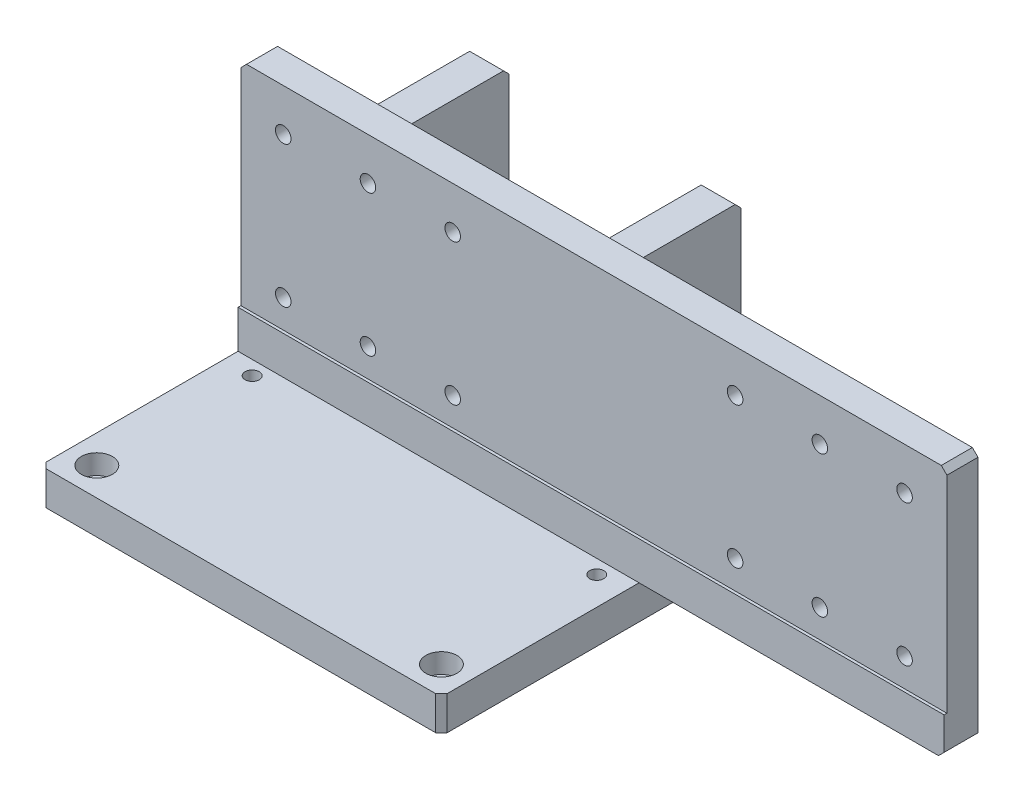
ISO-10303-21;
HEADER;
FILE_DESCRIPTION(('STEP AP214'),'2;1');
FILE_NAME('part.step','',(''),(''),'','','');
FILE_SCHEMA(('AUTOMOTIVE_DESIGN { 1 0 10303 214 1 1 1 1 }'));
ENDSEC;
DATA;
#1=APPLICATION_CONTEXT('core data for automotive mechanical design processes');
#2=APPLICATION_PROTOCOL_DEFINITION('international standard','automotive_design',2000,#1);
#3=PRODUCT_CONTEXT('',#1,'mechanical');
#4=PRODUCT('Part','Part','',(#3));
#5=PRODUCT_RELATED_PRODUCT_CATEGORY('part','',(#4));
#6=PRODUCT_DEFINITION_FORMATION('','',#4);
#7=PRODUCT_DEFINITION_CONTEXT('part definition',#1,'design');
#8=PRODUCT_DEFINITION('design','',#6,#7);
#9=PRODUCT_DEFINITION_SHAPE('','',#8);
#10=(LENGTH_UNIT() NAMED_UNIT(*) SI_UNIT(.MILLI.,.METRE.));
#11=(NAMED_UNIT(*) PLANE_ANGLE_UNIT() SI_UNIT($,.RADIAN.));
#12=(NAMED_UNIT(*) SI_UNIT($,.STERADIAN.) SOLID_ANGLE_UNIT());
#13=UNCERTAINTY_MEASURE_WITH_UNIT(LENGTH_MEASURE(1.E-05),#10,'distance_accuracy_value','');
#14=(GEOMETRIC_REPRESENTATION_CONTEXT(3) GLOBAL_UNCERTAINTY_ASSIGNED_CONTEXT((#13)) GLOBAL_UNIT_ASSIGNED_CONTEXT((#10,
#11,#12)) REPRESENTATION_CONTEXT('',''));
#15=CARTESIAN_POINT('',(0.,0.,0.));
#16=DIRECTION('',(0.,0.,1.));
#17=DIRECTION('',(1.,0.,0.));
#18=AXIS2_PLACEMENT_3D('',#15,#16,#17);
#19=CARTESIAN_POINT('',(35.,87.,-65.));
#20=DIRECTION('',(1.,0.,0.));
#21=DIRECTION('',(0.,0.,-1.));
#22=AXIS2_PLACEMENT_3D('',#19,#20,#21);
#23=PLANE('',#22);
#24=DIRECTION('',(0.,0.,1.));
#25=VECTOR('',#24,1.);
#26=CARTESIAN_POINT('',(35.,87.,-65.));
#27=LINE('',#26,#25);
#28=CARTESIAN_POINT('',(35.,87.,-63.));
#29=VERTEX_POINT('',#28);
#30=CARTESIAN_POINT('',(35.,87.,-17.));
#31=VERTEX_POINT('',#30);
#32=EDGE_CURVE('E108',#29,#31,#27,.T.);
#33=ORIENTED_EDGE('',*,*,#32,.F.);
#34=DIRECTION('',(0.,-0.707106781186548,-0.707106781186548));
#35=VECTOR('',#34,1.);
#36=CARTESIAN_POINT('',(35.,86.,-64.));
#37=LINE('',#36,#35);
#38=CARTESIAN_POINT('',(35.,85.,-65.));
#39=VERTEX_POINT('',#38);
#40=EDGE_CURVE('E61',#29,#39,#37,.T.);
#41=ORIENTED_EDGE('',*,*,#40,.T.);
#42=DIRECTION('',(0.,-1.,0.));
#43=VECTOR('',#42,1.);
#44=CARTESIAN_POINT('',(35.,87.,-65.));
#45=LINE('',#44,#43);
#46=CARTESIAN_POINT('',(35.,12.,-65.));
#47=VERTEX_POINT('',#46);
#48=EDGE_CURVE('E89',#39,#47,#45,.T.);
#49=ORIENTED_EDGE('',*,*,#48,.T.);
#50=DIRECTION('',(0.,0.,1.));
#51=VECTOR('',#50,1.);
#52=CARTESIAN_POINT('',(35.,12.,-65.));
#53=LINE('',#52,#51);
#54=CARTESIAN_POINT('',(35.,12.,-17.));
#55=VERTEX_POINT('',#54);
#56=EDGE_CURVE('E94',#47,#55,#53,.T.);
#57=ORIENTED_EDGE('',*,*,#56,.T.);
#58=DIRECTION('',(0.,-1.,0.));
#59=VECTOR('',#58,1.);
#60=CARTESIAN_POINT('',(35.,87.,-17.));
#61=LINE('',#60,#59);
#62=EDGE_CURVE('E55',#31,#55,#61,.T.);
#63=ORIENTED_EDGE('',*,*,#62,.F.);
#64=EDGE_LOOP('',(#33,#41,#49,#57,#63));
#65=FACE_BOUND('',#64,.T.);
#66=ADVANCED_FACE('F48',(#65),#23,.F.);
#67=CARTESIAN_POINT('',(35.,87.,-17.));
#68=DIRECTION('',(0.,0.,-1.));
#69=DIRECTION('',(-1.,0.,0.));
#70=AXIS2_PLACEMENT_3D('',#67,#68,#69);
#71=PLANE('',#70);
#72=DIRECTION('',(1.,0.,0.));
#73=VECTOR('',#72,1.);
#74=CARTESIAN_POINT('',(35.,12.,-17.));
#75=LINE('',#74,#73);
#76=CARTESIAN_POINT('',(47.,12.,-17.));
#77=VERTEX_POINT('',#76);
#78=EDGE_CURVE('E112',#55,#77,#75,.T.);
#79=ORIENTED_EDGE('',*,*,#78,.T.);
#80=DIRECTION('',(0.,-1.,0.));
#81=VECTOR('',#80,1.);
#82=CARTESIAN_POINT('',(47.,87.,-17.));
#83=LINE('',#82,#81);
#84=CARTESIAN_POINT('',(47.,87.,-17.));
#85=VERTEX_POINT('',#84);
#86=EDGE_CURVE('E123',#85,#77,#83,.T.);
#87=ORIENTED_EDGE('',*,*,#86,.F.);
#88=DIRECTION('',(1.,0.,0.));
#89=VECTOR('',#88,1.);
#90=CARTESIAN_POINT('',(35.,87.,-17.));
#91=LINE('',#90,#89);
#92=EDGE_CURVE('E70',#31,#85,#91,.T.);
#93=ORIENTED_EDGE('',*,*,#92,.F.);
#94=ORIENTED_EDGE('',*,*,#62,.T.);
#95=EDGE_LOOP('',(#79,#87,#93,#94));
#96=FACE_BOUND('',#95,.T.);
#97=ADVANCED_FACE('F126',(#96),#71,.F.);
#98=CARTESIAN_POINT('',(47.,87.,-65.));
#99=DIRECTION('',(-1.,0.,0.));
#100=DIRECTION('',(0.,0.,1.));
#101=AXIS2_PLACEMENT_3D('',#98,#99,#100);
#102=PLANE('',#101);
#103=DIRECTION('',(0.,-1.,0.));
#104=VECTOR('',#103,1.);
#105=CARTESIAN_POINT('',(47.,87.,-65.));
#106=LINE('',#105,#104);
#107=CARTESIAN_POINT('',(46.9999999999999,85.,-65.));
#108=VERTEX_POINT('',#107);
#109=CARTESIAN_POINT('',(47.,12.,-65.));
#110=VERTEX_POINT('',#109);
#111=EDGE_CURVE('E98',#108,#110,#106,.T.);
#112=ORIENTED_EDGE('',*,*,#111,.F.);
#113=DIRECTION('',(0.,0.707106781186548,0.707106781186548));
#114=VECTOR('',#113,1.);
#115=CARTESIAN_POINT('',(47.,86.,-64.));
#116=LINE('',#115,#114);
#117=CARTESIAN_POINT('',(46.9999999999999,87.,-63.));
#118=VERTEX_POINT('',#117);
#119=EDGE_CURVE('E116',#108,#118,#116,.T.);
#120=ORIENTED_EDGE('',*,*,#119,.T.);
#121=DIRECTION('',(0.,0.,-1.));
#122=VECTOR('',#121,1.);
#123=CARTESIAN_POINT('',(47.,87.,-65.));
#124=LINE('',#123,#122);
#125=EDGE_CURVE('E99',#85,#118,#124,.T.);
#126=ORIENTED_EDGE('',*,*,#125,.F.);
#127=ORIENTED_EDGE('',*,*,#86,.T.);
#128=DIRECTION('',(0.,0.,-1.));
#129=VECTOR('',#128,1.);
#130=CARTESIAN_POINT('',(47.,12.,-65.));
#131=LINE('',#130,#129);
#132=EDGE_CURVE('E109',#77,#110,#131,.T.);
#133=ORIENTED_EDGE('',*,*,#132,.T.);
#134=EDGE_LOOP('',(#112,#120,#126,#127,#133));
#135=FACE_BOUND('',#134,.T.);
#136=ADVANCED_FACE('F136',(#135),#102,.F.);
#137=CARTESIAN_POINT('',(35.,87.,-65.));
#138=DIRECTION('',(0.,0.,1.));
#139=DIRECTION('',(1.,0.,0.));
#140=AXIS2_PLACEMENT_3D('',#137,#138,#139);
#141=PLANE('',#140);
#142=ORIENTED_EDGE('',*,*,#48,.F.);
#143=DIRECTION('',(1.,0.,0.));
#144=VECTOR('',#143,1.);
#145=CARTESIAN_POINT('',(-71.,85.,-65.0000000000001));
#146=LINE('',#145,#144);
#147=EDGE_CURVE('E131',#39,#108,#146,.T.);
#148=ORIENTED_EDGE('',*,*,#147,.T.);
#149=ORIENTED_EDGE('',*,*,#111,.T.);
#150=DIRECTION('',(-1.,0.,0.));
#151=VECTOR('',#150,1.);
#152=CARTESIAN_POINT('',(35.,12.,-65.));
#153=LINE('',#152,#151);
#154=EDGE_CURVE('E102',#110,#47,#153,.T.);
#155=ORIENTED_EDGE('',*,*,#154,.T.);
#156=EDGE_LOOP('',(#142,#148,#149,#155));
#157=FACE_BOUND('',#156,.T.);
#158=ADVANCED_FACE('F103',(#157),#141,.F.);
#159=CARTESIAN_POINT('',(0.,87.,0.));
#160=DIRECTION('',(0.,1.,0.));
#161=DIRECTION('',(0.,0.,1.));
#162=AXIS2_PLACEMENT_3D('',#159,#160,#161);
#163=PLANE('',#162);
#164=DIRECTION('',(1.,0.,0.));
#165=VECTOR('',#164,1.);
#166=CARTESIAN_POINT('',(0.,87.,-63.));
#167=LINE('',#166,#165);
#168=EDGE_CURVE('E12',#29,#118,#167,.T.);
#169=ORIENTED_EDGE('',*,*,#168,.F.);
#170=ORIENTED_EDGE('',*,*,#32,.T.);
#171=ORIENTED_EDGE('',*,*,#92,.T.);
#172=ORIENTED_EDGE('',*,*,#125,.T.);
#173=EDGE_LOOP('',(#169,#170,#171,#172));
#174=FACE_BOUND('',#173,.T.);
#175=ADVANCED_FACE('F138',(#174),#163,.T.);
#176=CARTESIAN_POINT('',(0.,12.,0.));
#177=DIRECTION('',(0.,1.,0.));
#178=DIRECTION('',(0.,0.,1.));
#179=AXIS2_PLACEMENT_3D('',#176,#177,#178);
#180=PLANE('',#179);
#181=ORIENTED_EDGE('',*,*,#56,.F.);
#182=ORIENTED_EDGE('',*,*,#154,.F.);
#183=ORIENTED_EDGE('',*,*,#132,.F.);
#184=ORIENTED_EDGE('',*,*,#78,.F.);
#185=EDGE_LOOP('',(#181,#182,#183,#184));
#186=FACE_BOUND('',#185,.T.);
#187=ADVANCED_FACE('F111',(#186),#180,.F.);
#188=CARTESIAN_POINT('',(-71.,87.,-63.0000000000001));
#189=DIRECTION('',(0.,-0.707106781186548,0.707106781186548));
#190=DIRECTION('',(0.,-0.707106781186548,-0.707106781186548));
#191=AXIS2_PLACEMENT_3D('',#188,#189,#190);
#192=PLANE('',#191);
#193=ORIENTED_EDGE('',*,*,#168,.T.);
#194=ORIENTED_EDGE('',*,*,#119,.F.);
#195=ORIENTED_EDGE('',*,*,#147,.F.);
#196=ORIENTED_EDGE('',*,*,#40,.F.);
#197=EDGE_LOOP('',(#193,#194,#195,#196));
#198=FACE_BOUND('',#197,.T.);
#199=ADVANCED_FACE('F140',(#198),#192,.F.);
#200=CLOSED_SHELL('',(#66,#97,#136,#158,#175,#187,#199));
#201=MANIFOLD_SOLID_BREP('B2',#200);
#202=CARTESIAN_POINT('',(-47.,87.,-65.));
#203=DIRECTION('',(1.,0.,0.));
#204=DIRECTION('',(0.,0.,-1.));
#205=AXIS2_PLACEMENT_3D('',#202,#203,#204);
#206=PLANE('',#205);
#207=DIRECTION('',(0.,0.,1.));
#208=VECTOR('',#207,1.);
#209=CARTESIAN_POINT('',(-47.,87.,-65.));
#210=LINE('',#209,#208);
#211=CARTESIAN_POINT('',(-47.,87.,-63.0000000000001));
#212=VERTEX_POINT('',#211);
#213=CARTESIAN_POINT('',(-47.,87.,-17.));
#214=VERTEX_POINT('',#213);
#215=EDGE_CURVE('E268',#212,#214,#210,.T.);
#216=ORIENTED_EDGE('',*,*,#215,.F.);
#217=DIRECTION('',(0.,-0.707106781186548,-0.707106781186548));
#218=VECTOR('',#217,1.);
#219=CARTESIAN_POINT('',(-47.,86.,-64.));
#220=LINE('',#219,#218);
#221=CARTESIAN_POINT('',(-47.,85.,-65.0000000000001));
#222=VERTEX_POINT('',#221);
#223=EDGE_CURVE('E221',#212,#222,#220,.T.);
#224=ORIENTED_EDGE('',*,*,#223,.T.);
#225=DIRECTION('',(0.,-1.,0.));
#226=VECTOR('',#225,1.);
#227=CARTESIAN_POINT('',(-47.,87.,-65.));
#228=LINE('',#227,#226);
#229=CARTESIAN_POINT('',(-47.,12.,-65.));
#230=VERTEX_POINT('',#229);
#231=EDGE_CURVE('E249',#222,#230,#228,.T.);
#232=ORIENTED_EDGE('',*,*,#231,.T.);
#233=DIRECTION('',(0.,0.,1.));
#234=VECTOR('',#233,1.);
#235=CARTESIAN_POINT('',(-47.,12.,-65.));
#236=LINE('',#235,#234);
#237=CARTESIAN_POINT('',(-47.,12.,-17.));
#238=VERTEX_POINT('',#237);
#239=EDGE_CURVE('E254',#230,#238,#236,.T.);
#240=ORIENTED_EDGE('',*,*,#239,.T.);
#241=DIRECTION('',(0.,-1.,0.));
#242=VECTOR('',#241,1.);
#243=CARTESIAN_POINT('',(-47.,87.,-17.));
#244=LINE('',#243,#242);
#245=EDGE_CURVE('E215',#214,#238,#244,.T.);
#246=ORIENTED_EDGE('',*,*,#245,.F.);
#247=EDGE_LOOP('',(#216,#224,#232,#240,#246));
#248=FACE_BOUND('',#247,.T.);
#249=ADVANCED_FACE('F208',(#248),#206,.F.);
#250=CARTESIAN_POINT('',(-47.,87.,-17.));
#251=DIRECTION('',(0.,0.,-1.));
#252=DIRECTION('',(-1.,0.,0.));
#253=AXIS2_PLACEMENT_3D('',#250,#251,#252);
#254=PLANE('',#253);
#255=DIRECTION('',(1.,0.,0.));
#256=VECTOR('',#255,1.);
#257=CARTESIAN_POINT('',(-47.,12.,-17.));
#258=LINE('',#257,#256);
#259=CARTESIAN_POINT('',(-35.,12.,-17.));
#260=VERTEX_POINT('',#259);
#261=EDGE_CURVE('E272',#238,#260,#258,.T.);
#262=ORIENTED_EDGE('',*,*,#261,.T.);
#263=DIRECTION('',(0.,-1.,0.));
#264=VECTOR('',#263,1.);
#265=CARTESIAN_POINT('',(-35.,87.,-17.));
#266=LINE('',#265,#264);
#267=CARTESIAN_POINT('',(-35.,87.,-17.));
#268=VERTEX_POINT('',#267);
#269=EDGE_CURVE('E283',#268,#260,#266,.T.);
#270=ORIENTED_EDGE('',*,*,#269,.F.);
#271=DIRECTION('',(1.,0.,0.));
#272=VECTOR('',#271,1.);
#273=CARTESIAN_POINT('',(-47.,87.,-17.));
#274=LINE('',#273,#272);
#275=EDGE_CURVE('E230',#214,#268,#274,.T.);
#276=ORIENTED_EDGE('',*,*,#275,.F.);
#277=ORIENTED_EDGE('',*,*,#245,.T.);
#278=EDGE_LOOP('',(#262,#270,#276,#277));
#279=FACE_BOUND('',#278,.T.);
#280=ADVANCED_FACE('F286',(#279),#254,.F.);
#281=CARTESIAN_POINT('',(-35.,87.,-65.));
#282=DIRECTION('',(-1.,0.,0.));
#283=DIRECTION('',(0.,0.,1.));
#284=AXIS2_PLACEMENT_3D('',#281,#282,#283);
#285=PLANE('',#284);
#286=DIRECTION('',(0.,-1.,0.));
#287=VECTOR('',#286,1.);
#288=CARTESIAN_POINT('',(-35.,87.,-65.));
#289=LINE('',#288,#287);
#290=CARTESIAN_POINT('',(-35.,85.,-65.));
#291=VERTEX_POINT('',#290);
#292=CARTESIAN_POINT('',(-35.,12.,-65.));
#293=VERTEX_POINT('',#292);
#294=EDGE_CURVE('E258',#291,#293,#289,.T.);
#295=ORIENTED_EDGE('',*,*,#294,.F.);
#296=DIRECTION('',(0.,0.707106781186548,0.707106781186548));
#297=VECTOR('',#296,1.);
#298=CARTESIAN_POINT('',(-35.,86.,-64.));
#299=LINE('',#298,#297);
#300=CARTESIAN_POINT('',(-35.,87.,-63.));
#301=VERTEX_POINT('',#300);
#302=EDGE_CURVE('E276',#291,#301,#299,.T.);
#303=ORIENTED_EDGE('',*,*,#302,.T.);
#304=DIRECTION('',(0.,0.,-1.));
#305=VECTOR('',#304,1.);
#306=CARTESIAN_POINT('',(-35.,87.,-65.));
#307=LINE('',#306,#305);
#308=EDGE_CURVE('E259',#268,#301,#307,.T.);
#309=ORIENTED_EDGE('',*,*,#308,.F.);
#310=ORIENTED_EDGE('',*,*,#269,.T.);
#311=DIRECTION('',(0.,0.,-1.));
#312=VECTOR('',#311,1.);
#313=CARTESIAN_POINT('',(-35.,12.,-65.));
#314=LINE('',#313,#312);
#315=EDGE_CURVE('E269',#260,#293,#314,.T.);
#316=ORIENTED_EDGE('',*,*,#315,.T.);
#317=EDGE_LOOP('',(#295,#303,#309,#310,#316));
#318=FACE_BOUND('',#317,.T.);
#319=ADVANCED_FACE('F296',(#318),#285,.F.);
#320=CARTESIAN_POINT('',(-47.,87.,-65.));
#321=DIRECTION('',(0.,0.,1.));
#322=DIRECTION('',(1.,0.,0.));
#323=AXIS2_PLACEMENT_3D('',#320,#321,#322);
#324=PLANE('',#323);
#325=ORIENTED_EDGE('',*,*,#231,.F.);
#326=DIRECTION('',(1.,0.,0.));
#327=VECTOR('',#326,1.);
#328=CARTESIAN_POINT('',(-71.,85.,-65.0000000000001));
#329=LINE('',#328,#327);
#330=EDGE_CURVE('E291',#222,#291,#329,.T.);
#331=ORIENTED_EDGE('',*,*,#330,.T.);
#332=ORIENTED_EDGE('',*,*,#294,.T.);
#333=DIRECTION('',(-1.,0.,0.));
#334=VECTOR('',#333,1.);
#335=CARTESIAN_POINT('',(-47.,12.,-65.));
#336=LINE('',#335,#334);
#337=EDGE_CURVE('E262',#293,#230,#336,.T.);
#338=ORIENTED_EDGE('',*,*,#337,.T.);
#339=EDGE_LOOP('',(#325,#331,#332,#338));
#340=FACE_BOUND('',#339,.T.);
#341=ADVANCED_FACE('F263',(#340),#324,.F.);
#342=CARTESIAN_POINT('',(0.,87.,0.));
#343=DIRECTION('',(0.,1.,0.));
#344=DIRECTION('',(0.,0.,1.));
#345=AXIS2_PLACEMENT_3D('',#342,#343,#344);
#346=PLANE('',#345);
#347=DIRECTION('',(1.,0.,0.));
#348=VECTOR('',#347,1.);
#349=CARTESIAN_POINT('',(0.,87.,-63.));
#350=LINE('',#349,#348);
#351=EDGE_CURVE('E46',#212,#301,#350,.T.);
#352=ORIENTED_EDGE('',*,*,#351,.F.);
#353=ORIENTED_EDGE('',*,*,#215,.T.);
#354=ORIENTED_EDGE('',*,*,#275,.T.);
#355=ORIENTED_EDGE('',*,*,#308,.T.);
#356=EDGE_LOOP('',(#352,#353,#354,#355));
#357=FACE_BOUND('',#356,.T.);
#358=ADVANCED_FACE('F298',(#357),#346,.T.);
#359=CARTESIAN_POINT('',(0.,12.,0.));
#360=DIRECTION('',(0.,1.,0.));
#361=DIRECTION('',(0.,0.,1.));
#362=AXIS2_PLACEMENT_3D('',#359,#360,#361);
#363=PLANE('',#362);
#364=ORIENTED_EDGE('',*,*,#239,.F.);
#365=ORIENTED_EDGE('',*,*,#337,.F.);
#366=ORIENTED_EDGE('',*,*,#315,.F.);
#367=ORIENTED_EDGE('',*,*,#261,.F.);
#368=EDGE_LOOP('',(#364,#365,#366,#367));
#369=FACE_BOUND('',#368,.T.);
#370=ADVANCED_FACE('F271',(#369),#363,.F.);
#371=CARTESIAN_POINT('',(-71.,87.,-63.0000000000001));
#372=DIRECTION('',(0.,-0.707106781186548,0.707106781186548));
#373=DIRECTION('',(0.,-0.707106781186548,-0.707106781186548));
#374=AXIS2_PLACEMENT_3D('',#371,#372,#373);
#375=PLANE('',#374);
#376=ORIENTED_EDGE('',*,*,#351,.T.);
#377=ORIENTED_EDGE('',*,*,#302,.F.);
#378=ORIENTED_EDGE('',*,*,#330,.F.);
#379=ORIENTED_EDGE('',*,*,#223,.F.);
#380=EDGE_LOOP('',(#376,#377,#378,#379));
#381=FACE_BOUND('',#380,.T.);
#382=ADVANCED_FACE('F300',(#381),#375,.F.);
#383=CLOSED_SHELL('',(#249,#280,#319,#341,#358,#370,#382));
#384=MANIFOLD_SOLID_BREP('B6',#383);
#385=CARTESIAN_POINT('',(0.,100.5,0.));
#386=DIRECTION('',(0.,1.,0.));
#387=DIRECTION('',(0.,0.,1.));
#388=AXIS2_PLACEMENT_3D('',#385,#386,#387);
#389=PLANE('',#388);
#390=DIRECTION('',(-1.,0.,0.));
#391=VECTOR('',#390,1.);
#392=CARTESIAN_POINT('',(-71.,100.5,-6.00000000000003));
#393=LINE('',#392,#391);
#394=CARTESIAN_POINT('',(177.,100.5,-6.00000000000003));
#395=VERTEX_POINT('',#394);
#396=CARTESIAN_POINT('',(-69.,100.5,-6.00000000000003));
#397=VERTEX_POINT('',#396);
#398=EDGE_CURVE('E461',#395,#397,#393,.T.);
#399=ORIENTED_EDGE('',*,*,#398,.F.);
#400=DIRECTION('',(0.,0.,-1.));
#401=VECTOR('',#400,1.);
#402=CARTESIAN_POINT('',(177.,100.5,-17.));
#403=LINE('',#402,#401);
#404=CARTESIAN_POINT('',(177.,100.5,-17.));
#405=VERTEX_POINT('',#404);
#406=EDGE_CURVE('E633',#395,#405,#403,.T.);
#407=ORIENTED_EDGE('',*,*,#406,.T.);
#408=DIRECTION('',(-1.,0.,0.));
#409=VECTOR('',#408,1.);
#410=CARTESIAN_POINT('',(-71.,100.5,-17.));
#411=LINE('',#410,#409);
#412=CARTESIAN_POINT('',(-69.,100.5,-17.));
#413=VERTEX_POINT('',#412);
#414=EDGE_CURVE('E610',#405,#413,#411,.T.);
#415=ORIENTED_EDGE('',*,*,#414,.T.);
#416=DIRECTION('',(0.,0.,1.));
#417=VECTOR('',#416,1.);
#418=CARTESIAN_POINT('',(-69.,100.5,-6.00000000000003));
#419=LINE('',#418,#417);
#420=EDGE_CURVE('E628',#413,#397,#419,.T.);
#421=ORIENTED_EDGE('',*,*,#420,.T.);
#422=EDGE_LOOP('',(#399,#407,#415,#421));
#423=FACE_BOUND('',#422,.T.);
#424=ADVANCED_FACE('F367',(#423),#389,.T.);
#425=CARTESIAN_POINT('',(-56.,35.5,-17.));
#426=DIRECTION('',(0.,0.,-1.));
#427=DIRECTION('',(-1.,0.,0.));
#428=AXIS2_PLACEMENT_3D('',#425,#426,#427);
#429=CYLINDRICAL_SURFACE('',#428,2.74999999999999);
#430=CARTESIAN_POINT('',(-56.,35.5,-11.));
#431=DIRECTION('',(0.,0.,-1.));
#432=DIRECTION('',(-1.,0.,0.));
#433=AXIS2_PLACEMENT_3D('',#430,#431,#432);
#434=CIRCLE('',#433,2.75);
#435=CARTESIAN_POINT('',(-58.75,35.5,-11.));
#436=VERTEX_POINT('',#435);
#437=EDGE_CURVE('E606',#436,#436,#434,.T.);
#438=ORIENTED_EDGE('',*,*,#437,.T.);
#439=EDGE_LOOP('',(#438));
#440=FACE_BOUND('',#439,.T.);
#441=CARTESIAN_POINT('',(-56.,35.5,-6.00000000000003));
#442=DIRECTION('',(0.,0.,1.));
#443=DIRECTION('',(1.,0.,0.));
#444=AXIS2_PLACEMENT_3D('',#441,#442,#443);
#445=CIRCLE('',#444,2.74999999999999);
#446=CARTESIAN_POINT('',(-53.25,35.5,-6.00000000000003));
#447=VERTEX_POINT('',#446);
#448=EDGE_CURVE('E498',#447,#447,#445,.F.);
#449=ORIENTED_EDGE('',*,*,#448,.F.);
#450=EDGE_LOOP('',(#449));
#451=FACE_BOUND('',#450,.T.);
#452=ADVANCED_FACE('F687',(#440,#451),#429,.F.);
#453=CARTESIAN_POINT('',(-26.,35.5,-17.));
#454=DIRECTION('',(0.,0.,-1.));
#455=DIRECTION('',(-1.,0.,0.));
#456=AXIS2_PLACEMENT_3D('',#453,#454,#455);
#457=CYLINDRICAL_SURFACE('',#456,2.74999999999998);
#458=CARTESIAN_POINT('',(-26.,35.5,-11.));
#459=DIRECTION('',(0.,0.,-1.));
#460=DIRECTION('',(-1.,0.,0.));
#461=AXIS2_PLACEMENT_3D('',#458,#459,#460);
#462=CIRCLE('',#461,2.75);
#463=CARTESIAN_POINT('',(-28.75,35.5,-11.));
#464=VERTEX_POINT('',#463);
#465=EDGE_CURVE('E597',#464,#464,#462,.T.);
#466=ORIENTED_EDGE('',*,*,#465,.T.);
#467=EDGE_LOOP('',(#466));
#468=FACE_BOUND('',#467,.T.);
#469=CARTESIAN_POINT('',(-26.,35.5,-6.00000000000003));
#470=DIRECTION('',(0.,0.,1.));
#471=DIRECTION('',(1.,0.,0.));
#472=AXIS2_PLACEMENT_3D('',#469,#470,#471);
#473=CIRCLE('',#472,2.74999999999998);
#474=CARTESIAN_POINT('',(-23.25,35.5,-6.00000000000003));
#475=VERTEX_POINT('',#474);
#476=EDGE_CURVE('E495',#475,#475,#473,.F.);
#477=ORIENTED_EDGE('',*,*,#476,.F.);
#478=EDGE_LOOP('',(#477));
#479=FACE_BOUND('',#478,.T.);
#480=ADVANCED_FACE('F692',(#468,#479),#457,.F.);
#481=CARTESIAN_POINT('',(3.99999999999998,35.5,-17.));
#482=DIRECTION('',(0.,0.,-1.));
#483=DIRECTION('',(-1.,0.,0.));
#484=AXIS2_PLACEMENT_3D('',#481,#482,#483);
#485=CYLINDRICAL_SURFACE('',#484,2.74999999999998);
#486=CARTESIAN_POINT('',(3.99999999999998,35.5,-11.));
#487=DIRECTION('',(0.,0.,-1.));
#488=DIRECTION('',(-1.,0.,0.));
#489=AXIS2_PLACEMENT_3D('',#486,#487,#488);
#490=CIRCLE('',#489,2.75);
#491=CARTESIAN_POINT('',(1.24999999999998,35.5,-11.));
#492=VERTEX_POINT('',#491);
#493=EDGE_CURVE('E588',#492,#492,#490,.T.);
#494=ORIENTED_EDGE('',*,*,#493,.T.);
#495=EDGE_LOOP('',(#494));
#496=FACE_BOUND('',#495,.T.);
#497=CARTESIAN_POINT('',(3.99999999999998,35.5,-6.00000000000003));
#498=DIRECTION('',(0.,0.,1.));
#499=DIRECTION('',(1.,0.,0.));
#500=AXIS2_PLACEMENT_3D('',#497,#498,#499);
#501=CIRCLE('',#500,2.74999999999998);
#502=CARTESIAN_POINT('',(6.74999999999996,35.5,-6.00000000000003));
#503=VERTEX_POINT('',#502);
#504=EDGE_CURVE('E492',#503,#503,#501,.F.);
#505=ORIENTED_EDGE('',*,*,#504,.F.);
#506=EDGE_LOOP('',(#505));
#507=FACE_BOUND('',#506,.T.);
#508=ADVANCED_FACE('F1043',(#496,#507),#485,.F.);
#509=CARTESIAN_POINT('',(-56.,85.5,-17.));
#510=DIRECTION('',(0.,0.,-1.));
#511=DIRECTION('',(-1.,0.,0.));
#512=AXIS2_PLACEMENT_3D('',#509,#510,#511);
#513=CYLINDRICAL_SURFACE('',#512,2.74999999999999);
#514=CARTESIAN_POINT('',(-56.,85.5,-11.));
#515=DIRECTION('',(0.,0.,-1.));
#516=DIRECTION('',(-1.,0.,0.));
#517=AXIS2_PLACEMENT_3D('',#514,#515,#516);
#518=CIRCLE('',#517,2.75);
#519=CARTESIAN_POINT('',(-58.75,85.5,-11.));
#520=VERTEX_POINT('',#519);
#521=EDGE_CURVE('E579',#520,#520,#518,.T.);
#522=ORIENTED_EDGE('',*,*,#521,.T.);
#523=EDGE_LOOP('',(#522));
#524=FACE_BOUND('',#523,.T.);
#525=CARTESIAN_POINT('',(-56.,85.5,-6.00000000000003));
#526=DIRECTION('',(0.,0.,1.));
#527=DIRECTION('',(1.,0.,0.));
#528=AXIS2_PLACEMENT_3D('',#525,#526,#527);
#529=CIRCLE('',#528,2.74999999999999);
#530=CARTESIAN_POINT('',(-53.25,85.5,-6.00000000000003));
#531=VERTEX_POINT('',#530);
#532=EDGE_CURVE('E489',#531,#531,#529,.F.);
#533=ORIENTED_EDGE('',*,*,#532,.F.);
#534=EDGE_LOOP('',(#533));
#535=FACE_BOUND('',#534,.T.);
#536=ADVANCED_FACE('F1034',(#524,#535),#513,.F.);
#537=CARTESIAN_POINT('',(-26.,85.5,-17.));
#538=DIRECTION('',(0.,0.,-1.));
#539=DIRECTION('',(-1.,0.,0.));
#540=AXIS2_PLACEMENT_3D('',#537,#538,#539);
#541=CYLINDRICAL_SURFACE('',#540,2.74999999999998);
#542=CARTESIAN_POINT('',(-26.,85.5,-11.));
#543=DIRECTION('',(0.,0.,-1.));
#544=DIRECTION('',(-1.,0.,0.));
#545=AXIS2_PLACEMENT_3D('',#542,#543,#544);
#546=CIRCLE('',#545,2.75);
#547=CARTESIAN_POINT('',(-28.75,85.5,-11.));
#548=VERTEX_POINT('',#547);
#549=EDGE_CURVE('E570',#548,#548,#546,.T.);
#550=ORIENTED_EDGE('',*,*,#549,.T.);
#551=EDGE_LOOP('',(#550));
#552=FACE_BOUND('',#551,.T.);
#553=CARTESIAN_POINT('',(-26.,85.5,-6.00000000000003));
#554=DIRECTION('',(0.,0.,1.));
#555=DIRECTION('',(1.,0.,0.));
#556=AXIS2_PLACEMENT_3D('',#553,#554,#555);
#557=CIRCLE('',#556,2.74999999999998);
#558=CARTESIAN_POINT('',(-23.25,85.5,-6.00000000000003));
#559=VERTEX_POINT('',#558);
#560=EDGE_CURVE('E486',#559,#559,#557,.F.);
#561=ORIENTED_EDGE('',*,*,#560,.F.);
#562=EDGE_LOOP('',(#561));
#563=FACE_BOUND('',#562,.T.);
#564=ADVANCED_FACE('F1025',(#552,#563),#541,.F.);
#565=CARTESIAN_POINT('',(3.99999999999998,85.5,-17.));
#566=DIRECTION('',(0.,0.,-1.));
#567=DIRECTION('',(-1.,0.,0.));
#568=AXIS2_PLACEMENT_3D('',#565,#566,#567);
#569=CYLINDRICAL_SURFACE('',#568,2.74999999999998);
#570=CARTESIAN_POINT('',(3.99999999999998,85.5,-11.));
#571=DIRECTION('',(0.,0.,-1.));
#572=DIRECTION('',(-1.,0.,0.));
#573=AXIS2_PLACEMENT_3D('',#570,#571,#572);
#574=CIRCLE('',#573,2.75);
#575=CARTESIAN_POINT('',(1.24999999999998,85.5,-11.));
#576=VERTEX_POINT('',#575);
#577=EDGE_CURVE('E561',#576,#576,#574,.T.);
#578=ORIENTED_EDGE('',*,*,#577,.T.);
#579=EDGE_LOOP('',(#578));
#580=FACE_BOUND('',#579,.T.);
#581=CARTESIAN_POINT('',(3.99999999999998,85.5,-6.00000000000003));
#582=DIRECTION('',(0.,0.,1.));
#583=DIRECTION('',(1.,0.,0.));
#584=AXIS2_PLACEMENT_3D('',#581,#582,#583);
#585=CIRCLE('',#584,2.74999999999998);
#586=CARTESIAN_POINT('',(6.74999999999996,85.5,-6.00000000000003));
#587=VERTEX_POINT('',#586);
#588=EDGE_CURVE('E483',#587,#587,#585,.F.);
#589=ORIENTED_EDGE('',*,*,#588,.F.);
#590=EDGE_LOOP('',(#589));
#591=FACE_BOUND('',#590,.T.);
#592=ADVANCED_FACE('F1016',(#580,#591),#569,.F.);
#593=CARTESIAN_POINT('',(104.,35.5,-17.));
#594=DIRECTION('',(0.,0.,-1.));
#595=DIRECTION('',(-1.,0.,0.));
#596=AXIS2_PLACEMENT_3D('',#593,#594,#595);
#597=CYLINDRICAL_SURFACE('',#596,2.75);
#598=CARTESIAN_POINT('',(104.,35.5,-11.));
#599=DIRECTION('',(0.,0.,-1.));
#600=DIRECTION('',(-1.,0.,0.));
#601=AXIS2_PLACEMENT_3D('',#598,#599,#600);
#602=CIRCLE('',#601,2.75);
#603=CARTESIAN_POINT('',(101.25,35.5,-11.));
#604=VERTEX_POINT('',#603);
#605=EDGE_CURVE('E552',#604,#604,#602,.T.);
#606=ORIENTED_EDGE('',*,*,#605,.T.);
#607=EDGE_LOOP('',(#606));
#608=FACE_BOUND('',#607,.T.);
#609=CARTESIAN_POINT('',(104.,35.5,-6.00000000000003));
#610=DIRECTION('',(0.,0.,1.));
#611=DIRECTION('',(1.,0.,0.));
#612=AXIS2_PLACEMENT_3D('',#609,#610,#611);
#613=CIRCLE('',#612,2.75);
#614=CARTESIAN_POINT('',(106.75,35.5,-6.00000000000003));
#615=VERTEX_POINT('',#614);
#616=EDGE_CURVE('E480',#615,#615,#613,.F.);
#617=ORIENTED_EDGE('',*,*,#616,.F.);
#618=EDGE_LOOP('',(#617));
#619=FACE_BOUND('',#618,.T.);
#620=ADVANCED_FACE('F1007',(#608,#619),#597,.F.);
#621=CARTESIAN_POINT('',(134.,35.5,-17.));
#622=DIRECTION('',(0.,0.,-1.));
#623=DIRECTION('',(-1.,0.,0.));
#624=AXIS2_PLACEMENT_3D('',#621,#622,#623);
#625=CYLINDRICAL_SURFACE('',#624,2.75);
#626=CARTESIAN_POINT('',(134.,35.5,-11.));
#627=DIRECTION('',(0.,0.,-1.));
#628=DIRECTION('',(-1.,0.,0.));
#629=AXIS2_PLACEMENT_3D('',#626,#627,#628);
#630=CIRCLE('',#629,2.75);
#631=CARTESIAN_POINT('',(131.25,35.5,-11.));
#632=VERTEX_POINT('',#631);
#633=EDGE_CURVE('E543',#632,#632,#630,.T.);
#634=ORIENTED_EDGE('',*,*,#633,.T.);
#635=EDGE_LOOP('',(#634));
#636=FACE_BOUND('',#635,.T.);
#637=CARTESIAN_POINT('',(134.,35.5,-6.00000000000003));
#638=DIRECTION('',(0.,0.,1.));
#639=DIRECTION('',(1.,0.,0.));
#640=AXIS2_PLACEMENT_3D('',#637,#638,#639);
#641=CIRCLE('',#640,2.75);
#642=CARTESIAN_POINT('',(136.75,35.5,-6.00000000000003));
#643=VERTEX_POINT('',#642);
#644=EDGE_CURVE('E477',#643,#643,#641,.F.);
#645=ORIENTED_EDGE('',*,*,#644,.F.);
#646=EDGE_LOOP('',(#645));
#647=FACE_BOUND('',#646,.T.);
#648=ADVANCED_FACE('F998',(#636,#647),#625,.F.);
#649=CARTESIAN_POINT('',(164.,35.5,-17.));
#650=DIRECTION('',(0.,0.,-1.));
#651=DIRECTION('',(-1.,0.,0.));
#652=AXIS2_PLACEMENT_3D('',#649,#650,#651);
#653=CYLINDRICAL_SURFACE('',#652,2.75);
#654=CARTESIAN_POINT('',(164.,35.5,-11.));
#655=DIRECTION('',(0.,0.,-1.));
#656=DIRECTION('',(-1.,0.,0.));
#657=AXIS2_PLACEMENT_3D('',#654,#655,#656);
#658=CIRCLE('',#657,2.75);
#659=CARTESIAN_POINT('',(161.25,35.5,-11.));
#660=VERTEX_POINT('',#659);
#661=EDGE_CURVE('E534',#660,#660,#658,.T.);
#662=ORIENTED_EDGE('',*,*,#661,.T.);
#663=EDGE_LOOP('',(#662));
#664=FACE_BOUND('',#663,.T.);
#665=CARTESIAN_POINT('',(164.,35.5,-6.00000000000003));
#666=DIRECTION('',(0.,0.,1.));
#667=DIRECTION('',(1.,0.,0.));
#668=AXIS2_PLACEMENT_3D('',#665,#666,#667);
#669=CIRCLE('',#668,2.75);
#670=CARTESIAN_POINT('',(166.75,35.5,-6.00000000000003));
#671=VERTEX_POINT('',#670);
#672=EDGE_CURVE('E474',#671,#671,#669,.F.);
#673=ORIENTED_EDGE('',*,*,#672,.F.);
#674=EDGE_LOOP('',(#673));
#675=FACE_BOUND('',#674,.T.);
#676=ADVANCED_FACE('F989',(#664,#675),#653,.F.);
#677=CARTESIAN_POINT('',(104.,85.5,-17.));
#678=DIRECTION('',(0.,0.,-1.));
#679=DIRECTION('',(-1.,0.,0.));
#680=AXIS2_PLACEMENT_3D('',#677,#678,#679);
#681=CYLINDRICAL_SURFACE('',#680,2.75);
#682=CARTESIAN_POINT('',(104.,85.5,-11.));
#683=DIRECTION('',(0.,0.,-1.));
#684=DIRECTION('',(-1.,0.,0.));
#685=AXIS2_PLACEMENT_3D('',#682,#683,#684);
#686=CIRCLE('',#685,2.75);
#687=CARTESIAN_POINT('',(101.25,85.5,-11.));
#688=VERTEX_POINT('',#687);
#689=EDGE_CURVE('E525',#688,#688,#686,.T.);
#690=ORIENTED_EDGE('',*,*,#689,.T.);
#691=EDGE_LOOP('',(#690));
#692=FACE_BOUND('',#691,.T.);
#693=CARTESIAN_POINT('',(104.,85.5,-6.00000000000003));
#694=DIRECTION('',(0.,0.,1.));
#695=DIRECTION('',(1.,0.,0.));
#696=AXIS2_PLACEMENT_3D('',#693,#694,#695);
#697=CIRCLE('',#696,2.75);
#698=CARTESIAN_POINT('',(106.75,85.5,-6.00000000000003));
#699=VERTEX_POINT('',#698);
#700=EDGE_CURVE('E471',#699,#699,#697,.F.);
#701=ORIENTED_EDGE('',*,*,#700,.F.);
#702=EDGE_LOOP('',(#701));
#703=FACE_BOUND('',#702,.T.);
#704=ADVANCED_FACE('F980',(#692,#703),#681,.F.);
#705=CARTESIAN_POINT('',(134.,85.5,-17.));
#706=DIRECTION('',(0.,0.,-1.));
#707=DIRECTION('',(-1.,0.,0.));
#708=AXIS2_PLACEMENT_3D('',#705,#706,#707);
#709=CYLINDRICAL_SURFACE('',#708,2.75);
#710=CARTESIAN_POINT('',(134.,85.5,-11.));
#711=DIRECTION('',(0.,0.,-1.));
#712=DIRECTION('',(-1.,0.,0.));
#713=AXIS2_PLACEMENT_3D('',#710,#711,#712);
#714=CIRCLE('',#713,2.75);
#715=CARTESIAN_POINT('',(131.25,85.5,-11.));
#716=VERTEX_POINT('',#715);
#717=EDGE_CURVE('E516',#716,#716,#714,.T.);
#718=ORIENTED_EDGE('',*,*,#717,.T.);
#719=EDGE_LOOP('',(#718));
#720=FACE_BOUND('',#719,.T.);
#721=CARTESIAN_POINT('',(134.,85.5,-6.00000000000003));
#722=DIRECTION('',(0.,0.,1.));
#723=DIRECTION('',(1.,0.,0.));
#724=AXIS2_PLACEMENT_3D('',#721,#722,#723);
#725=CIRCLE('',#724,2.75);
#726=CARTESIAN_POINT('',(136.75,85.5,-6.00000000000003));
#727=VERTEX_POINT('',#726);
#728=EDGE_CURVE('E468',#727,#727,#725,.F.);
#729=ORIENTED_EDGE('',*,*,#728,.F.);
#730=EDGE_LOOP('',(#729));
#731=FACE_BOUND('',#730,.T.);
#732=ADVANCED_FACE('F973',(#720,#731),#709,.F.);
#733=CARTESIAN_POINT('',(164.,85.5,-17.));
#734=DIRECTION('',(0.,0.,-1.));
#735=DIRECTION('',(-1.,0.,0.));
#736=AXIS2_PLACEMENT_3D('',#733,#734,#735);
#737=CYLINDRICAL_SURFACE('',#736,2.75);
#738=CARTESIAN_POINT('',(164.,85.5,-11.));
#739=DIRECTION('',(0.,0.,-1.));
#740=DIRECTION('',(-1.,0.,0.));
#741=AXIS2_PLACEMENT_3D('',#738,#739,#740);
#742=CIRCLE('',#741,2.75);
#743=CARTESIAN_POINT('',(161.25,85.5,-11.));
#744=VERTEX_POINT('',#743);
#745=EDGE_CURVE('E507',#744,#744,#742,.T.);
#746=ORIENTED_EDGE('',*,*,#745,.T.);
#747=EDGE_LOOP('',(#746));
#748=FACE_BOUND('',#747,.T.);
#749=CARTESIAN_POINT('',(164.,85.5,-6.00000000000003));
#750=DIRECTION('',(0.,0.,1.));
#751=DIRECTION('',(1.,0.,0.));
#752=AXIS2_PLACEMENT_3D('',#749,#750,#751);
#753=CIRCLE('',#752,2.75);
#754=CARTESIAN_POINT('',(166.75,85.5,-6.00000000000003));
#755=VERTEX_POINT('',#754);
#756=EDGE_CURVE('E463',#755,#755,#753,.F.);
#757=ORIENTED_EDGE('',*,*,#756,.F.);
#758=EDGE_LOOP('',(#757));
#759=FACE_BOUND('',#758,.T.);
#760=ADVANCED_FACE('F702',(#748,#759),#737,.F.);
#761=CARTESIAN_POINT('',(-71.,100.5,-17.));
#762=DIRECTION('',(0.,0.,1.));
#763=DIRECTION('',(1.,0.,0.));
#764=AXIS2_PLACEMENT_3D('',#761,#762,#763);
#765=PLANE('',#764);
#766=CARTESIAN_POINT('',(164.,85.5,-17.));
#767=DIRECTION('',(0.,0.,-1.));
#768=DIRECTION('',(-1.,0.,0.));
#769=AXIS2_PLACEMENT_3D('',#766,#767,#768);
#770=CIRCLE('',#769,4.75);
#771=CARTESIAN_POINT('',(159.25,85.5,-17.));
#772=VERTEX_POINT('',#771);
#773=EDGE_CURVE('E501',#772,#772,#770,.T.);
#774=ORIENTED_EDGE('',*,*,#773,.F.);
#775=EDGE_LOOP('',(#774));
#776=FACE_BOUND('',#775,.T.);
#777=CARTESIAN_POINT('',(134.,85.5,-17.));
#778=DIRECTION('',(0.,0.,-1.));
#779=DIRECTION('',(-1.,0.,0.));
#780=AXIS2_PLACEMENT_3D('',#777,#778,#779);
#781=CIRCLE('',#780,4.75);
#782=CARTESIAN_POINT('',(129.25,85.5,-17.));
#783=VERTEX_POINT('',#782);
#784=EDGE_CURVE('E510',#783,#783,#781,.T.);
#785=ORIENTED_EDGE('',*,*,#784,.F.);
#786=EDGE_LOOP('',(#785));
#787=FACE_BOUND('',#786,.T.);
#788=CARTESIAN_POINT('',(104.,85.5,-17.));
#789=DIRECTION('',(0.,0.,-1.));
#790=DIRECTION('',(-1.,0.,0.));
#791=AXIS2_PLACEMENT_3D('',#788,#789,#790);
#792=CIRCLE('',#791,4.75);
#793=CARTESIAN_POINT('',(99.25,85.5,-17.));
#794=VERTEX_POINT('',#793);
#795=EDGE_CURVE('E519',#794,#794,#792,.T.);
#796=ORIENTED_EDGE('',*,*,#795,.F.);
#797=EDGE_LOOP('',(#796));
#798=FACE_BOUND('',#797,.T.);
#799=CARTESIAN_POINT('',(164.,35.5,-17.));
#800=DIRECTION('',(0.,0.,-1.));
#801=DIRECTION('',(-1.,0.,0.));
#802=AXIS2_PLACEMENT_3D('',#799,#800,#801);
#803=CIRCLE('',#802,4.75);
#804=CARTESIAN_POINT('',(159.25,35.5,-17.));
#805=VERTEX_POINT('',#804);
#806=EDGE_CURVE('E528',#805,#805,#803,.T.);
#807=ORIENTED_EDGE('',*,*,#806,.F.);
#808=EDGE_LOOP('',(#807));
#809=FACE_BOUND('',#808,.T.);
#810=CARTESIAN_POINT('',(104.,35.5,-17.));
#811=DIRECTION('',(0.,0.,-1.));
#812=DIRECTION('',(-1.,0.,0.));
#813=AXIS2_PLACEMENT_3D('',#810,#811,#812);
#814=CIRCLE('',#813,4.75);
#815=CARTESIAN_POINT('',(99.25,35.5,-17.));
#816=VERTEX_POINT('',#815);
#817=EDGE_CURVE('E546',#816,#816,#814,.T.);
#818=ORIENTED_EDGE('',*,*,#817,.F.);
#819=EDGE_LOOP('',(#818));
#820=FACE_BOUND('',#819,.T.);
#821=CARTESIAN_POINT('',(3.99999999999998,85.5,-17.));
#822=DIRECTION('',(0.,0.,-1.));
#823=DIRECTION('',(-1.,0.,0.));
#824=AXIS2_PLACEMENT_3D('',#821,#822,#823);
#825=CIRCLE('',#824,4.75);
#826=CARTESIAN_POINT('',(-0.750000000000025,85.5,-17.));
#827=VERTEX_POINT('',#826);
#828=EDGE_CURVE('E555',#827,#827,#825,.T.);
#829=ORIENTED_EDGE('',*,*,#828,.F.);
#830=EDGE_LOOP('',(#829));
#831=FACE_BOUND('',#830,.T.);
#832=CARTESIAN_POINT('',(-26.,85.5,-17.));
#833=DIRECTION('',(0.,0.,-1.));
#834=DIRECTION('',(-1.,0.,0.));
#835=AXIS2_PLACEMENT_3D('',#832,#833,#834);
#836=CIRCLE('',#835,4.75);
#837=CARTESIAN_POINT('',(-30.75,85.5,-17.));
#838=VERTEX_POINT('',#837);
#839=EDGE_CURVE('E564',#838,#838,#836,.T.);
#840=ORIENTED_EDGE('',*,*,#839,.F.);
#841=EDGE_LOOP('',(#840));
#842=FACE_BOUND('',#841,.T.);
#843=CARTESIAN_POINT('',(-56.,85.5,-17.));
#844=DIRECTION('',(0.,0.,-1.));
#845=DIRECTION('',(-1.,0.,0.));
#846=AXIS2_PLACEMENT_3D('',#843,#844,#845);
#847=CIRCLE('',#846,4.75);
#848=CARTESIAN_POINT('',(-60.75,85.5,-17.));
#849=VERTEX_POINT('',#848);
#850=EDGE_CURVE('E573',#849,#849,#847,.T.);
#851=ORIENTED_EDGE('',*,*,#850,.F.);
#852=EDGE_LOOP('',(#851));
#853=FACE_BOUND('',#852,.T.);
#854=CARTESIAN_POINT('',(3.99999999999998,35.5,-17.));
#855=DIRECTION('',(0.,0.,-1.));
#856=DIRECTION('',(-1.,0.,0.));
#857=AXIS2_PLACEMENT_3D('',#854,#855,#856);
#858=CIRCLE('',#857,4.75);
#859=CARTESIAN_POINT('',(-0.750000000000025,35.5,-17.));
#860=VERTEX_POINT('',#859);
#861=EDGE_CURVE('E582',#860,#860,#858,.T.);
#862=ORIENTED_EDGE('',*,*,#861,.F.);
#863=EDGE_LOOP('',(#862));
#864=FACE_BOUND('',#863,.T.);
#865=CARTESIAN_POINT('',(-26.,35.5,-17.));
#866=DIRECTION('',(0.,0.,-1.));
#867=DIRECTION('',(-1.,0.,0.));
#868=AXIS2_PLACEMENT_3D('',#865,#866,#867);
#869=CIRCLE('',#868,4.75);
#870=CARTESIAN_POINT('',(-30.75,35.5,-17.));
#871=VERTEX_POINT('',#870);
#872=EDGE_CURVE('E591',#871,#871,#869,.T.);
#873=ORIENTED_EDGE('',*,*,#872,.F.);
#874=EDGE_LOOP('',(#873));
#875=FACE_BOUND('',#874,.T.);
#876=CARTESIAN_POINT('',(-56.,35.5,-17.));
#877=DIRECTION('',(0.,0.,-1.));
#878=DIRECTION('',(-1.,0.,0.));
#879=AXIS2_PLACEMENT_3D('',#876,#877,#878);
#880=CIRCLE('',#879,4.75);
#881=CARTESIAN_POINT('',(-60.75,35.5,-17.));
#882=VERTEX_POINT('',#881);
#883=EDGE_CURVE('E600',#882,#882,#880,.T.);
#884=ORIENTED_EDGE('',*,*,#883,.F.);
#885=EDGE_LOOP('',(#884));
#886=FACE_BOUND('',#885,.T.);
#887=ORIENTED_EDGE('',*,*,#414,.F.);
#888=DIRECTION('',(0.707106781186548,-0.707106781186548,0.));
#889=VECTOR('',#888,1.);
#890=CARTESIAN_POINT('',(177.,100.5,-17.));
#891=LINE('',#890,#889);
#892=CARTESIAN_POINT('',(179.,98.5,-17.));
#893=VERTEX_POINT('',#892);
#894=EDGE_CURVE('E640',#405,#893,#891,.T.);
#895=ORIENTED_EDGE('',*,*,#894,.T.);
#896=DIRECTION('',(0.,-1.,0.));
#897=VECTOR('',#896,1.);
#898=CARTESIAN_POINT('',(179.,100.5,-17.));
#899=LINE('',#898,#897);
#900=CARTESIAN_POINT('',(179.,14.,-17.));
#901=VERTEX_POINT('',#900);
#902=EDGE_CURVE('E621',#893,#901,#899,.T.);
#903=ORIENTED_EDGE('',*,*,#902,.T.);
#904=DIRECTION('',(0.707106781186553,0.707106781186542,0.));
#905=VECTOR('',#904,1.);
#906=CARTESIAN_POINT('',(179.,14.,-17.));
#907=LINE('',#906,#905);
#908=CARTESIAN_POINT('',(177.,12.,-17.));
#909=VERTEX_POINT('',#908);
#910=EDGE_CURVE('E638',#901,#909,#907,.F.);
#911=ORIENTED_EDGE('',*,*,#910,.T.);
#912=DIRECTION('',(-1.,0.,0.));
#913=VECTOR('',#912,1.);
#914=CARTESIAN_POINT('',(-71.,12.,-17.));
#915=LINE('',#914,#913);
#916=CARTESIAN_POINT('',(-71.,12.,-17.));
#917=VERTEX_POINT('',#916);
#918=EDGE_CURVE('E614',#909,#917,#915,.T.);
#919=ORIENTED_EDGE('',*,*,#918,.T.);
#920=DIRECTION('',(0.,-1.,0.));
#921=VECTOR('',#920,1.);
#922=CARTESIAN_POINT('',(-71.,100.5,-17.));
#923=LINE('',#922,#921);
#924=CARTESIAN_POINT('',(-71.,98.5,-17.));
#925=VERTEX_POINT('',#924);
#926=EDGE_CURVE('E613',#925,#917,#923,.T.);
#927=ORIENTED_EDGE('',*,*,#926,.F.);
#928=DIRECTION('',(0.707106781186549,0.707106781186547,0.));
#929=VECTOR('',#928,1.);
#930=CARTESIAN_POINT('',(-69.,100.5,-17.));
#931=LINE('',#930,#929);
#932=EDGE_CURVE('E636',#925,#413,#931,.T.);
#933=ORIENTED_EDGE('',*,*,#932,.T.);
#934=EDGE_LOOP('',(#887,#895,#903,#911,#919,#927,#933));
#935=FACE_BOUND('',#934,.T.);
#936=CARTESIAN_POINT('',(134.,35.5,-17.));
#937=DIRECTION('',(0.,0.,-1.));
#938=DIRECTION('',(-1.,0.,0.));
#939=AXIS2_PLACEMENT_3D('',#936,#937,#938);
#940=CIRCLE('',#939,4.75);
#941=CARTESIAN_POINT('',(129.25,35.5,-17.));
#942=VERTEX_POINT('',#941);
#943=EDGE_CURVE('E537',#942,#942,#940,.T.);
#944=ORIENTED_EDGE('',*,*,#943,.F.);
#945=EDGE_LOOP('',(#944));
#946=FACE_BOUND('',#945,.T.);
#947=ADVANCED_FACE('F662',(#776,#787,#798,#809,#820,#831,#842,#853,#864,#875,#886,#935,#946),
#765,.F.);
#948=CARTESIAN_POINT('',(-71.,100.5,-17.));
#949=DIRECTION('',(1.,0.,0.));
#950=DIRECTION('',(0.,0.,-1.));
#951=AXIS2_PLACEMENT_3D('',#948,#949,#950);
#952=PLANE('',#951);
#953=DIRECTION('',(0.,-1.,0.));
#954=VECTOR('',#953,1.);
#955=CARTESIAN_POINT('',(-71.,100.5,-6.00000000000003));
#956=LINE('',#955,#954);
#957=CARTESIAN_POINT('',(-71.,98.5,-6.00000000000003));
#958=VERTEX_POINT('',#957);
#959=CARTESIAN_POINT('',(-71.,25.5,-6.00000000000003));
#960=VERTEX_POINT('',#959);
#961=EDGE_CURVE('E437',#958,#960,#956,.T.);
#962=ORIENTED_EDGE('',*,*,#961,.F.);
#963=DIRECTION('',(0.,0.,-1.));
#964=VECTOR('',#963,1.);
#965=CARTESIAN_POINT('',(-71.,98.5,-17.));
#966=LINE('',#965,#964);
#967=EDGE_CURVE('E206',#958,#925,#966,.T.);
#968=ORIENTED_EDGE('',*,*,#967,.T.);
#969=ORIENTED_EDGE('',*,*,#926,.T.);
#970=DIRECTION('',(0.,0.,1.));
#971=VECTOR('',#970,1.);
#972=CARTESIAN_POINT('',(-71.,12.,-17.));
#973=LINE('',#972,#971);
#974=CARTESIAN_POINT('',(-71.,12.,-5.00000000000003));
#975=VERTEX_POINT('',#974);
#976=EDGE_CURVE('E609',#917,#975,#973,.T.);
#977=ORIENTED_EDGE('',*,*,#976,.T.);
#978=DIRECTION('',(0.,-1.,0.));
#979=VECTOR('',#978,1.);
#980=CARTESIAN_POINT('',(-71.,100.5,-5.00000000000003));
#981=LINE('',#980,#979);
#982=CARTESIAN_POINT('',(-71.,25.5,-5.00000000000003));
#983=VERTEX_POINT('',#982);
#984=EDGE_CURVE('E460',#983,#975,#981,.T.);
#985=ORIENTED_EDGE('',*,*,#984,.F.);
#986=DIRECTION('',(0.,0.,1.));
#987=VECTOR('',#986,1.);
#988=CARTESIAN_POINT('',(-71.,25.5,-6.00000000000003));
#989=LINE('',#988,#987);
#990=EDGE_CURVE('E451',#960,#983,#989,.T.);
#991=ORIENTED_EDGE('',*,*,#990,.F.);
#992=EDGE_LOOP('',(#962,#968,#969,#977,#985,#991));
#993=FACE_BOUND('',#992,.T.);
#994=ADVANCED_FACE('F458',(#993),#952,.F.);
#995=CARTESIAN_POINT('',(-71.,100.5,-5.00000000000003));
#996=DIRECTION('',(0.,0.,-1.));
#997=DIRECTION('',(-1.,0.,0.));
#998=AXIS2_PLACEMENT_3D('',#995,#996,#997);
#999=PLANE('',#998);
#1000=DIRECTION('',(1.,0.,0.));
#1001=VECTOR('',#1000,1.);
#1002=CARTESIAN_POINT('',(-71.,12.,-5.00000000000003));
#1003=LINE('',#1002,#1001);
#1004=CARTESIAN_POINT('',(177.,12.,-5.00000000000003));
#1005=VERTEX_POINT('',#1004);
#1006=EDGE_CURVE('E616',#975,#1005,#1003,.T.);
#1007=ORIENTED_EDGE('',*,*,#1006,.T.);
#1008=DIRECTION('',(-0.707106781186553,-0.707106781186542,0.));
#1009=VECTOR('',#1008,1.);
#1010=CARTESIAN_POINT('',(179.,14.,-5.00000000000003));
#1011=LINE('',#1010,#1009);
#1012=CARTESIAN_POINT('',(179.,14.,-5.00000000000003));
#1013=VERTEX_POINT('',#1012);
#1014=EDGE_CURVE('E375',#1005,#1013,#1011,.F.);
#1015=ORIENTED_EDGE('',*,*,#1014,.T.);
#1016=DIRECTION('',(0.,-1.,0.));
#1017=VECTOR('',#1016,1.);
#1018=CARTESIAN_POINT('',(179.,100.5,-5.00000000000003));
#1019=LINE('',#1018,#1017);
#1020=CARTESIAN_POINT('',(179.,25.5,-5.00000000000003));
#1021=VERTEX_POINT('',#1020);
#1022=EDGE_CURVE('E624',#1021,#1013,#1019,.T.);
#1023=ORIENTED_EDGE('',*,*,#1022,.F.);
#1024=DIRECTION('',(1.,0.,0.));
#1025=VECTOR('',#1024,1.);
#1026=CARTESIAN_POINT('',(-71.,25.5,-5.00000000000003));
#1027=LINE('',#1026,#1025);
#1028=EDGE_CURVE('E447',#983,#1021,#1027,.T.);
#1029=ORIENTED_EDGE('',*,*,#1028,.F.);
#1030=ORIENTED_EDGE('',*,*,#984,.T.);
#1031=EDGE_LOOP('',(#1007,#1015,#1023,#1029,#1030));
#1032=FACE_BOUND('',#1031,.T.);
#1033=ADVANCED_FACE('F653',(#1032),#999,.F.);
#1034=CARTESIAN_POINT('',(179.,100.5,-17.));
#1035=DIRECTION('',(-1.,0.,0.));
#1036=DIRECTION('',(0.,0.,1.));
#1037=AXIS2_PLACEMENT_3D('',#1034,#1035,#1036);
#1038=PLANE('',#1037);
#1039=ORIENTED_EDGE('',*,*,#902,.F.);
#1040=DIRECTION('',(0.,0.,1.));
#1041=VECTOR('',#1040,1.);
#1042=CARTESIAN_POINT('',(179.,98.5,-6.00000000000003));
#1043=LINE('',#1042,#1041);
#1044=CARTESIAN_POINT('',(179.,98.5,-6.00000000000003));
#1045=VERTEX_POINT('',#1044);
#1046=EDGE_CURVE('E645',#893,#1045,#1043,.T.);
#1047=ORIENTED_EDGE('',*,*,#1046,.T.);
#1048=DIRECTION('',(0.,1.,0.));
#1049=VECTOR('',#1048,1.);
#1050=CARTESIAN_POINT('',(179.,100.5,-6.00000000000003));
#1051=LINE('',#1050,#1049);
#1052=CARTESIAN_POINT('',(179.,25.5,-6.00000000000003));
#1053=VERTEX_POINT('',#1052);
#1054=EDGE_CURVE('E455',#1053,#1045,#1051,.T.);
#1055=ORIENTED_EDGE('',*,*,#1054,.F.);
#1056=DIRECTION('',(0.,0.,1.));
#1057=VECTOR('',#1056,1.);
#1058=CARTESIAN_POINT('',(179.,25.5,-6.00000000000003));
#1059=LINE('',#1058,#1057);
#1060=EDGE_CURVE('E454',#1053,#1021,#1059,.T.);
#1061=ORIENTED_EDGE('',*,*,#1060,.T.);
#1062=ORIENTED_EDGE('',*,*,#1022,.T.);
#1063=DIRECTION('',(0.,0.,-1.));
#1064=VECTOR('',#1063,1.);
#1065=CARTESIAN_POINT('',(179.,14.,-17.));
#1066=LINE('',#1065,#1064);
#1067=EDGE_CURVE('E642',#1013,#901,#1066,.T.);
#1068=ORIENTED_EDGE('',*,*,#1067,.T.);
#1069=EDGE_LOOP('',(#1039,#1047,#1055,#1061,#1062,#1068));
#1070=FACE_BOUND('',#1069,.T.);
#1071=ADVANCED_FACE('F658',(#1070),#1038,.F.);
#1072=CARTESIAN_POINT('',(0.,12.,0.));
#1073=DIRECTION('',(0.,1.,0.));
#1074=DIRECTION('',(0.,0.,1.));
#1075=AXIS2_PLACEMENT_3D('',#1072,#1073,#1074);
#1076=PLANE('',#1075);
#1077=ORIENTED_EDGE('',*,*,#918,.F.);
#1078=DIRECTION('',(0.,0.,1.));
#1079=VECTOR('',#1078,1.);
#1080=CARTESIAN_POINT('',(177.,12.,0.));
#1081=LINE('',#1080,#1079);
#1082=EDGE_CURVE('E382',#909,#1005,#1081,.T.);
#1083=ORIENTED_EDGE('',*,*,#1082,.T.);
#1084=ORIENTED_EDGE('',*,*,#1006,.F.);
#1085=ORIENTED_EDGE('',*,*,#976,.F.);
#1086=EDGE_LOOP('',(#1077,#1083,#1084,#1085));
#1087=FACE_BOUND('',#1086,.T.);
#1088=ADVANCED_FACE('F666',(#1087),#1076,.F.);
#1089=CARTESIAN_POINT('',(-53.25,35.5,-11.));
#1090=DIRECTION('',(0.,0.,1.));
#1091=DIRECTION('',(1.,0.,0.));
#1092=AXIS2_PLACEMENT_3D('',#1089,#1090,#1091);
#1093=PLANE('',#1092);
#1094=ORIENTED_EDGE('',*,*,#437,.F.);
#1095=EDGE_LOOP('',(#1094));
#1096=FACE_BOUND('',#1095,.T.);
#1097=CARTESIAN_POINT('',(-56.,35.5,-11.));
#1098=DIRECTION('',(0.,0.,-1.));
#1099=DIRECTION('',(-1.,0.,0.));
#1100=AXIS2_PLACEMENT_3D('',#1097,#1098,#1099);
#1101=CIRCLE('',#1100,4.75);
#1102=CARTESIAN_POINT('',(-60.75,35.5,-11.));
#1103=VERTEX_POINT('',#1102);
#1104=EDGE_CURVE('E603',#1103,#1103,#1101,.T.);
#1105=ORIENTED_EDGE('',*,*,#1104,.T.);
#1106=EDGE_LOOP('',(#1105));
#1107=FACE_BOUND('',#1106,.T.);
#1108=ADVANCED_FACE('F699',(#1096,#1107),#1093,.F.);
#1109=CARTESIAN_POINT('',(-56.,35.5,-17.));
#1110=DIRECTION('',(0.,0.,-1.));
#1111=DIRECTION('',(-1.,0.,0.));
#1112=AXIS2_PLACEMENT_3D('',#1109,#1110,#1111);
#1113=CYLINDRICAL_SURFACE('',#1112,4.75);
#1114=ORIENTED_EDGE('',*,*,#1104,.F.);
#1115=EDGE_LOOP('',(#1114));
#1116=FACE_BOUND('',#1115,.T.);
#1117=ORIENTED_EDGE('',*,*,#883,.T.);
#1118=EDGE_LOOP('',(#1117));
#1119=FACE_BOUND('',#1118,.T.);
#1120=ADVANCED_FACE('F732',(#1116,#1119),#1113,.F.);
#1121=CARTESIAN_POINT('',(-23.25,35.5,-11.));
#1122=DIRECTION('',(0.,0.,1.));
#1123=DIRECTION('',(1.,0.,0.));
#1124=AXIS2_PLACEMENT_3D('',#1121,#1122,#1123);
#1125=PLANE('',#1124);
#1126=ORIENTED_EDGE('',*,*,#465,.F.);
#1127=EDGE_LOOP('',(#1126));
#1128=FACE_BOUND('',#1127,.T.);
#1129=CARTESIAN_POINT('',(-26.,35.5,-11.));
#1130=DIRECTION('',(0.,0.,-1.));
#1131=DIRECTION('',(-1.,0.,0.));
#1132=AXIS2_PLACEMENT_3D('',#1129,#1130,#1131);
#1133=CIRCLE('',#1132,4.75);
#1134=CARTESIAN_POINT('',(-30.75,35.5,-11.));
#1135=VERTEX_POINT('',#1134);
#1136=EDGE_CURVE('E594',#1135,#1135,#1133,.T.);
#1137=ORIENTED_EDGE('',*,*,#1136,.T.);
#1138=EDGE_LOOP('',(#1137));
#1139=FACE_BOUND('',#1138,.T.);
#1140=ADVANCED_FACE('F739',(#1128,#1139),#1125,.F.);
#1141=CARTESIAN_POINT('',(-26.,35.5,-17.));
#1142=DIRECTION('',(0.,0.,-1.));
#1143=DIRECTION('',(-1.,0.,0.));
#1144=AXIS2_PLACEMENT_3D('',#1141,#1142,#1143);
#1145=CYLINDRICAL_SURFACE('',#1144,4.75);
#1146=ORIENTED_EDGE('',*,*,#1136,.F.);
#1147=EDGE_LOOP('',(#1146));
#1148=FACE_BOUND('',#1147,.T.);
#1149=ORIENTED_EDGE('',*,*,#872,.T.);
#1150=EDGE_LOOP('',(#1149));
#1151=FACE_BOUND('',#1150,.T.);
#1152=ADVANCED_FACE('F747',(#1148,#1151),#1145,.F.);
#1153=CARTESIAN_POINT('',(6.74999999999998,35.5,-11.));
#1154=DIRECTION('',(0.,0.,1.));
#1155=DIRECTION('',(1.,0.,0.));
#1156=AXIS2_PLACEMENT_3D('',#1153,#1154,#1155);
#1157=PLANE('',#1156);
#1158=ORIENTED_EDGE('',*,*,#493,.F.);
#1159=EDGE_LOOP('',(#1158));
#1160=FACE_BOUND('',#1159,.T.);
#1161=CARTESIAN_POINT('',(3.99999999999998,35.5,-11.));
#1162=DIRECTION('',(0.,0.,-1.));
#1163=DIRECTION('',(-1.,0.,0.));
#1164=AXIS2_PLACEMENT_3D('',#1161,#1162,#1163);
#1165=CIRCLE('',#1164,4.75);
#1166=CARTESIAN_POINT('',(-0.750000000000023,35.5,-11.));
#1167=VERTEX_POINT('',#1166);
#1168=EDGE_CURVE('E585',#1167,#1167,#1165,.T.);
#1169=ORIENTED_EDGE('',*,*,#1168,.T.);
#1170=EDGE_LOOP('',(#1169));
#1171=FACE_BOUND('',#1170,.T.);
#1172=ADVANCED_FACE('F755',(#1160,#1171),#1157,.F.);
#1173=CARTESIAN_POINT('',(3.99999999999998,35.5,-17.));
#1174=DIRECTION('',(0.,0.,-1.));
#1175=DIRECTION('',(-1.,0.,0.));
#1176=AXIS2_PLACEMENT_3D('',#1173,#1174,#1175);
#1177=CYLINDRICAL_SURFACE('',#1176,4.75);
#1178=ORIENTED_EDGE('',*,*,#1168,.F.);
#1179=EDGE_LOOP('',(#1178));
#1180=FACE_BOUND('',#1179,.T.);
#1181=ORIENTED_EDGE('',*,*,#861,.T.);
#1182=EDGE_LOOP('',(#1181));
#1183=FACE_BOUND('',#1182,.T.);
#1184=ADVANCED_FACE('F763',(#1180,#1183),#1177,.F.);
#1185=CARTESIAN_POINT('',(-53.25,85.5,-11.));
#1186=DIRECTION('',(0.,0.,1.));
#1187=DIRECTION('',(1.,0.,0.));
#1188=AXIS2_PLACEMENT_3D('',#1185,#1186,#1187);
#1189=PLANE('',#1188);
#1190=ORIENTED_EDGE('',*,*,#521,.F.);
#1191=EDGE_LOOP('',(#1190));
#1192=FACE_BOUND('',#1191,.T.);
#1193=CARTESIAN_POINT('',(-56.,85.5,-11.));
#1194=DIRECTION('',(0.,0.,-1.));
#1195=DIRECTION('',(-1.,0.,0.));
#1196=AXIS2_PLACEMENT_3D('',#1193,#1194,#1195);
#1197=CIRCLE('',#1196,4.75);
#1198=CARTESIAN_POINT('',(-60.75,85.5,-11.));
#1199=VERTEX_POINT('',#1198);
#1200=EDGE_CURVE('E576',#1199,#1199,#1197,.T.);
#1201=ORIENTED_EDGE('',*,*,#1200,.T.);
#1202=EDGE_LOOP('',(#1201));
#1203=FACE_BOUND('',#1202,.T.);
#1204=ADVANCED_FACE('F771',(#1192,#1203),#1189,.F.);
#1205=CARTESIAN_POINT('',(-56.,85.5,-17.));
#1206=DIRECTION('',(0.,0.,-1.));
#1207=DIRECTION('',(-1.,0.,0.));
#1208=AXIS2_PLACEMENT_3D('',#1205,#1206,#1207);
#1209=CYLINDRICAL_SURFACE('',#1208,4.75);
#1210=ORIENTED_EDGE('',*,*,#1200,.F.);
#1211=EDGE_LOOP('',(#1210));
#1212=FACE_BOUND('',#1211,.T.);
#1213=ORIENTED_EDGE('',*,*,#850,.T.);
#1214=EDGE_LOOP('',(#1213));
#1215=FACE_BOUND('',#1214,.T.);
#1216=ADVANCED_FACE('F779',(#1212,#1215),#1209,.F.);
#1217=CARTESIAN_POINT('',(-23.25,85.5,-11.));
#1218=DIRECTION('',(0.,0.,1.));
#1219=DIRECTION('',(1.,0.,0.));
#1220=AXIS2_PLACEMENT_3D('',#1217,#1218,#1219);
#1221=PLANE('',#1220);
#1222=ORIENTED_EDGE('',*,*,#549,.F.);
#1223=EDGE_LOOP('',(#1222));
#1224=FACE_BOUND('',#1223,.T.);
#1225=CARTESIAN_POINT('',(-26.,85.5,-11.));
#1226=DIRECTION('',(0.,0.,-1.));
#1227=DIRECTION('',(-1.,0.,0.));
#1228=AXIS2_PLACEMENT_3D('',#1225,#1226,#1227);
#1229=CIRCLE('',#1228,4.75);
#1230=CARTESIAN_POINT('',(-30.75,85.5,-11.));
#1231=VERTEX_POINT('',#1230);
#1232=EDGE_CURVE('E567',#1231,#1231,#1229,.T.);
#1233=ORIENTED_EDGE('',*,*,#1232,.T.);
#1234=EDGE_LOOP('',(#1233));
#1235=FACE_BOUND('',#1234,.T.);
#1236=ADVANCED_FACE('F787',(#1224,#1235),#1221,.F.);
#1237=CARTESIAN_POINT('',(-26.,85.5,-17.));
#1238=DIRECTION('',(0.,0.,-1.));
#1239=DIRECTION('',(-1.,0.,0.));
#1240=AXIS2_PLACEMENT_3D('',#1237,#1238,#1239);
#1241=CYLINDRICAL_SURFACE('',#1240,4.75);
#1242=ORIENTED_EDGE('',*,*,#1232,.F.);
#1243=EDGE_LOOP('',(#1242));
#1244=FACE_BOUND('',#1243,.T.);
#1245=ORIENTED_EDGE('',*,*,#839,.T.);
#1246=EDGE_LOOP('',(#1245));
#1247=FACE_BOUND('',#1246,.T.);
#1248=ADVANCED_FACE('F795',(#1244,#1247),#1241,.F.);
#1249=CARTESIAN_POINT('',(6.74999999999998,85.5,-11.));
#1250=DIRECTION('',(0.,0.,1.));
#1251=DIRECTION('',(1.,0.,0.));
#1252=AXIS2_PLACEMENT_3D('',#1249,#1250,#1251);
#1253=PLANE('',#1252);
#1254=ORIENTED_EDGE('',*,*,#577,.F.);
#1255=EDGE_LOOP('',(#1254));
#1256=FACE_BOUND('',#1255,.T.);
#1257=CARTESIAN_POINT('',(3.99999999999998,85.5,-11.));
#1258=DIRECTION('',(0.,0.,-1.));
#1259=DIRECTION('',(-1.,0.,0.));
#1260=AXIS2_PLACEMENT_3D('',#1257,#1258,#1259);
#1261=CIRCLE('',#1260,4.75);
#1262=CARTESIAN_POINT('',(-0.750000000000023,85.5,-11.));
#1263=VERTEX_POINT('',#1262);
#1264=EDGE_CURVE('E558',#1263,#1263,#1261,.T.);
#1265=ORIENTED_EDGE('',*,*,#1264,.T.);
#1266=EDGE_LOOP('',(#1265));
#1267=FACE_BOUND('',#1266,.T.);
#1268=ADVANCED_FACE('F803',(#1256,#1267),#1253,.F.);
#1269=CARTESIAN_POINT('',(3.99999999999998,85.5,-17.));
#1270=DIRECTION('',(0.,0.,-1.));
#1271=DIRECTION('',(-1.,0.,0.));
#1272=AXIS2_PLACEMENT_3D('',#1269,#1270,#1271);
#1273=CYLINDRICAL_SURFACE('',#1272,4.75);
#1274=ORIENTED_EDGE('',*,*,#1264,.F.);
#1275=EDGE_LOOP('',(#1274));
#1276=FACE_BOUND('',#1275,.T.);
#1277=ORIENTED_EDGE('',*,*,#828,.T.);
#1278=EDGE_LOOP('',(#1277));
#1279=FACE_BOUND('',#1278,.T.);
#1280=ADVANCED_FACE('F811',(#1276,#1279),#1273,.F.);
#1281=CARTESIAN_POINT('',(106.75,35.5,-11.));
#1282=DIRECTION('',(0.,0.,1.));
#1283=DIRECTION('',(1.,0.,0.));
#1284=AXIS2_PLACEMENT_3D('',#1281,#1282,#1283);
#1285=PLANE('',#1284);
#1286=ORIENTED_EDGE('',*,*,#605,.F.);
#1287=EDGE_LOOP('',(#1286));
#1288=FACE_BOUND('',#1287,.T.);
#1289=CARTESIAN_POINT('',(104.,35.5,-11.));
#1290=DIRECTION('',(0.,0.,-1.));
#1291=DIRECTION('',(-1.,0.,0.));
#1292=AXIS2_PLACEMENT_3D('',#1289,#1290,#1291);
#1293=CIRCLE('',#1292,4.75);
#1294=CARTESIAN_POINT('',(99.25,35.5,-11.));
#1295=VERTEX_POINT('',#1294);
#1296=EDGE_CURVE('E549',#1295,#1295,#1293,.T.);
#1297=ORIENTED_EDGE('',*,*,#1296,.T.);
#1298=EDGE_LOOP('',(#1297));
#1299=FACE_BOUND('',#1298,.T.);
#1300=ADVANCED_FACE('F819',(#1288,#1299),#1285,.F.);
#1301=CARTESIAN_POINT('',(104.,35.5,-17.));
#1302=DIRECTION('',(0.,0.,-1.));
#1303=DIRECTION('',(-1.,0.,0.));
#1304=AXIS2_PLACEMENT_3D('',#1301,#1302,#1303);
#1305=CYLINDRICAL_SURFACE('',#1304,4.75);
#1306=ORIENTED_EDGE('',*,*,#1296,.F.);
#1307=EDGE_LOOP('',(#1306));
#1308=FACE_BOUND('',#1307,.T.);
#1309=ORIENTED_EDGE('',*,*,#817,.T.);
#1310=EDGE_LOOP('',(#1309));
#1311=FACE_BOUND('',#1310,.T.);
#1312=ADVANCED_FACE('F827',(#1308,#1311),#1305,.F.);
#1313=CARTESIAN_POINT('',(136.75,35.5,-11.));
#1314=DIRECTION('',(0.,0.,1.));
#1315=DIRECTION('',(1.,0.,0.));
#1316=AXIS2_PLACEMENT_3D('',#1313,#1314,#1315);
#1317=PLANE('',#1316);
#1318=ORIENTED_EDGE('',*,*,#633,.F.);
#1319=EDGE_LOOP('',(#1318));
#1320=FACE_BOUND('',#1319,.T.);
#1321=CARTESIAN_POINT('',(134.,35.5,-11.));
#1322=DIRECTION('',(0.,0.,-1.));
#1323=DIRECTION('',(-1.,0.,0.));
#1324=AXIS2_PLACEMENT_3D('',#1321,#1322,#1323);
#1325=CIRCLE('',#1324,4.75);
#1326=CARTESIAN_POINT('',(129.25,35.5,-11.));
#1327=VERTEX_POINT('',#1326);
#1328=EDGE_CURVE('E540',#1327,#1327,#1325,.T.);
#1329=ORIENTED_EDGE('',*,*,#1328,.T.);
#1330=EDGE_LOOP('',(#1329));
#1331=FACE_BOUND('',#1330,.T.);
#1332=ADVANCED_FACE('F835',(#1320,#1331),#1317,.F.);
#1333=CARTESIAN_POINT('',(134.,35.5,-17.));
#1334=DIRECTION('',(0.,0.,-1.));
#1335=DIRECTION('',(-1.,0.,0.));
#1336=AXIS2_PLACEMENT_3D('',#1333,#1334,#1335);
#1337=CYLINDRICAL_SURFACE('',#1336,4.75);
#1338=ORIENTED_EDGE('',*,*,#1328,.F.);
#1339=EDGE_LOOP('',(#1338));
#1340=FACE_BOUND('',#1339,.T.);
#1341=ORIENTED_EDGE('',*,*,#943,.T.);
#1342=EDGE_LOOP('',(#1341));
#1343=FACE_BOUND('',#1342,.T.);
#1344=ADVANCED_FACE('F843',(#1340,#1343),#1337,.F.);
#1345=CARTESIAN_POINT('',(166.75,35.5,-11.));
#1346=DIRECTION('',(0.,0.,1.));
#1347=DIRECTION('',(1.,0.,0.));
#1348=AXIS2_PLACEMENT_3D('',#1345,#1346,#1347);
#1349=PLANE('',#1348);
#1350=ORIENTED_EDGE('',*,*,#661,.F.);
#1351=EDGE_LOOP('',(#1350));
#1352=FACE_BOUND('',#1351,.T.);
#1353=CARTESIAN_POINT('',(164.,35.5,-11.));
#1354=DIRECTION('',(0.,0.,-1.));
#1355=DIRECTION('',(-1.,0.,0.));
#1356=AXIS2_PLACEMENT_3D('',#1353,#1354,#1355);
#1357=CIRCLE('',#1356,4.75);
#1358=CARTESIAN_POINT('',(159.25,35.5,-11.));
#1359=VERTEX_POINT('',#1358);
#1360=EDGE_CURVE('E531',#1359,#1359,#1357,.T.);
#1361=ORIENTED_EDGE('',*,*,#1360,.T.);
#1362=EDGE_LOOP('',(#1361));
#1363=FACE_BOUND('',#1362,.T.);
#1364=ADVANCED_FACE('F851',(#1352,#1363),#1349,.F.);
#1365=CARTESIAN_POINT('',(164.,35.5,-17.));
#1366=DIRECTION('',(0.,0.,-1.));
#1367=DIRECTION('',(-1.,0.,0.));
#1368=AXIS2_PLACEMENT_3D('',#1365,#1366,#1367);
#1369=CYLINDRICAL_SURFACE('',#1368,4.75);
#1370=ORIENTED_EDGE('',*,*,#1360,.F.);
#1371=EDGE_LOOP('',(#1370));
#1372=FACE_BOUND('',#1371,.T.);
#1373=ORIENTED_EDGE('',*,*,#806,.T.);
#1374=EDGE_LOOP('',(#1373));
#1375=FACE_BOUND('',#1374,.T.);
#1376=ADVANCED_FACE('F859',(#1372,#1375),#1369,.F.);
#1377=CARTESIAN_POINT('',(106.75,85.5,-11.));
#1378=DIRECTION('',(0.,0.,1.));
#1379=DIRECTION('',(1.,0.,0.));
#1380=AXIS2_PLACEMENT_3D('',#1377,#1378,#1379);
#1381=PLANE('',#1380);
#1382=ORIENTED_EDGE('',*,*,#689,.F.);
#1383=EDGE_LOOP('',(#1382));
#1384=FACE_BOUND('',#1383,.T.);
#1385=CARTESIAN_POINT('',(104.,85.5,-11.));
#1386=DIRECTION('',(0.,0.,-1.));
#1387=DIRECTION('',(-1.,0.,0.));
#1388=AXIS2_PLACEMENT_3D('',#1385,#1386,#1387);
#1389=CIRCLE('',#1388,4.75);
#1390=CARTESIAN_POINT('',(99.25,85.5,-11.));
#1391=VERTEX_POINT('',#1390);
#1392=EDGE_CURVE('E522',#1391,#1391,#1389,.T.);
#1393=ORIENTED_EDGE('',*,*,#1392,.T.);
#1394=EDGE_LOOP('',(#1393));
#1395=FACE_BOUND('',#1394,.T.);
#1396=ADVANCED_FACE('F867',(#1384,#1395),#1381,.F.);
#1397=CARTESIAN_POINT('',(104.,85.5,-17.));
#1398=DIRECTION('',(0.,0.,-1.));
#1399=DIRECTION('',(-1.,0.,0.));
#1400=AXIS2_PLACEMENT_3D('',#1397,#1398,#1399);
#1401=CYLINDRICAL_SURFACE('',#1400,4.75);
#1402=ORIENTED_EDGE('',*,*,#1392,.F.);
#1403=EDGE_LOOP('',(#1402));
#1404=FACE_BOUND('',#1403,.T.);
#1405=ORIENTED_EDGE('',*,*,#795,.T.);
#1406=EDGE_LOOP('',(#1405));
#1407=FACE_BOUND('',#1406,.T.);
#1408=ADVANCED_FACE('F875',(#1404,#1407),#1401,.F.);
#1409=CARTESIAN_POINT('',(136.75,85.5,-11.));
#1410=DIRECTION('',(0.,0.,1.));
#1411=DIRECTION('',(1.,0.,0.));
#1412=AXIS2_PLACEMENT_3D('',#1409,#1410,#1411);
#1413=PLANE('',#1412);
#1414=ORIENTED_EDGE('',*,*,#717,.F.);
#1415=EDGE_LOOP('',(#1414));
#1416=FACE_BOUND('',#1415,.T.);
#1417=CARTESIAN_POINT('',(134.,85.5,-11.));
#1418=DIRECTION('',(0.,0.,-1.));
#1419=DIRECTION('',(-1.,0.,0.));
#1420=AXIS2_PLACEMENT_3D('',#1417,#1418,#1419);
#1421=CIRCLE('',#1420,4.75);
#1422=CARTESIAN_POINT('',(129.25,85.5,-11.));
#1423=VERTEX_POINT('',#1422);
#1424=EDGE_CURVE('E513',#1423,#1423,#1421,.T.);
#1425=ORIENTED_EDGE('',*,*,#1424,.T.);
#1426=EDGE_LOOP('',(#1425));
#1427=FACE_BOUND('',#1426,.T.);
#1428=ADVANCED_FACE('F883',(#1416,#1427),#1413,.F.);
#1429=CARTESIAN_POINT('',(134.,85.5,-17.));
#1430=DIRECTION('',(0.,0.,-1.));
#1431=DIRECTION('',(-1.,0.,0.));
#1432=AXIS2_PLACEMENT_3D('',#1429,#1430,#1431);
#1433=CYLINDRICAL_SURFACE('',#1432,4.75);
#1434=ORIENTED_EDGE('',*,*,#1424,.F.);
#1435=EDGE_LOOP('',(#1434));
#1436=FACE_BOUND('',#1435,.T.);
#1437=ORIENTED_EDGE('',*,*,#784,.T.);
#1438=EDGE_LOOP('',(#1437));
#1439=FACE_BOUND('',#1438,.T.);
#1440=ADVANCED_FACE('F891',(#1436,#1439),#1433,.F.);
#1441=CARTESIAN_POINT('',(166.75,85.5,-11.));
#1442=DIRECTION('',(0.,0.,1.));
#1443=DIRECTION('',(1.,0.,0.));
#1444=AXIS2_PLACEMENT_3D('',#1441,#1442,#1443);
#1445=PLANE('',#1444);
#1446=ORIENTED_EDGE('',*,*,#745,.F.);
#1447=EDGE_LOOP('',(#1446));
#1448=FACE_BOUND('',#1447,.T.);
#1449=CARTESIAN_POINT('',(164.,85.5,-11.));
#1450=DIRECTION('',(0.,0.,-1.));
#1451=DIRECTION('',(-1.,0.,0.));
#1452=AXIS2_PLACEMENT_3D('',#1449,#1450,#1451);
#1453=CIRCLE('',#1452,4.75);
#1454=CARTESIAN_POINT('',(159.25,85.5,-11.));
#1455=VERTEX_POINT('',#1454);
#1456=EDGE_CURVE('E504',#1455,#1455,#1453,.T.);
#1457=ORIENTED_EDGE('',*,*,#1456,.T.);
#1458=EDGE_LOOP('',(#1457));
#1459=FACE_BOUND('',#1458,.T.);
#1460=ADVANCED_FACE('F899',(#1448,#1459),#1445,.F.);
#1461=CARTESIAN_POINT('',(164.,85.5,-17.));
#1462=DIRECTION('',(0.,0.,-1.));
#1463=DIRECTION('',(-1.,0.,0.));
#1464=AXIS2_PLACEMENT_3D('',#1461,#1462,#1463);
#1465=CYLINDRICAL_SURFACE('',#1464,4.75);
#1466=ORIENTED_EDGE('',*,*,#1456,.F.);
#1467=EDGE_LOOP('',(#1466));
#1468=FACE_BOUND('',#1467,.T.);
#1469=ORIENTED_EDGE('',*,*,#773,.T.);
#1470=EDGE_LOOP('',(#1469));
#1471=FACE_BOUND('',#1470,.T.);
#1472=ADVANCED_FACE('F907',(#1468,#1471),#1465,.F.);
#1473=CARTESIAN_POINT('',(0.,0.,-6.00000000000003));
#1474=DIRECTION('',(0.,0.,1.));
#1475=DIRECTION('',(1.,0.,0.));
#1476=AXIS2_PLACEMENT_3D('',#1473,#1474,#1475);
#1477=PLANE('',#1476);
#1478=ORIENTED_EDGE('',*,*,#1054,.T.);
#1479=DIRECTION('',(-0.707106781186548,0.707106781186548,0.));
#1480=VECTOR('',#1479,1.);
#1481=CARTESIAN_POINT('',(138.75,138.75,-6.00000000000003));
#1482=LINE('',#1481,#1480);
#1483=EDGE_CURVE('E648',#1045,#395,#1482,.T.);
#1484=ORIENTED_EDGE('',*,*,#1483,.T.);
#1485=ORIENTED_EDGE('',*,*,#398,.T.);
#1486=DIRECTION('',(-0.707106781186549,-0.707106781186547,0.));
#1487=VECTOR('',#1486,1.);
#1488=CARTESIAN_POINT('',(-84.7499999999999,84.7500000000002,-6.00000000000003));
#1489=LINE('',#1488,#1487);
#1490=EDGE_CURVE('E390',#397,#958,#1489,.T.);
#1491=ORIENTED_EDGE('',*,*,#1490,.T.);
#1492=ORIENTED_EDGE('',*,*,#961,.T.);
#1493=DIRECTION('',(1.,0.,0.));
#1494=VECTOR('',#1493,1.);
#1495=CARTESIAN_POINT('',(-71.,25.5,-6.00000000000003));
#1496=LINE('',#1495,#1494);
#1497=EDGE_CURVE('E442',#960,#1053,#1496,.T.);
#1498=ORIENTED_EDGE('',*,*,#1497,.T.);
#1499=EDGE_LOOP('',(#1478,#1484,#1485,#1491,#1492,#1498));
#1500=FACE_BOUND('',#1499,.T.);
#1501=ORIENTED_EDGE('',*,*,#756,.T.);
#1502=EDGE_LOOP('',(#1501));
#1503=FACE_BOUND('',#1502,.T.);
#1504=ORIENTED_EDGE('',*,*,#728,.T.);
#1505=EDGE_LOOP('',(#1504));
#1506=FACE_BOUND('',#1505,.T.);
#1507=ORIENTED_EDGE('',*,*,#700,.T.);
#1508=EDGE_LOOP('',(#1507));
#1509=FACE_BOUND('',#1508,.T.);
#1510=ORIENTED_EDGE('',*,*,#672,.T.);
#1511=EDGE_LOOP('',(#1510));
#1512=FACE_BOUND('',#1511,.T.);
#1513=ORIENTED_EDGE('',*,*,#644,.T.);
#1514=EDGE_LOOP('',(#1513));
#1515=FACE_BOUND('',#1514,.T.);
#1516=ORIENTED_EDGE('',*,*,#616,.T.);
#1517=EDGE_LOOP('',(#1516));
#1518=FACE_BOUND('',#1517,.T.);
#1519=ORIENTED_EDGE('',*,*,#588,.T.);
#1520=EDGE_LOOP('',(#1519));
#1521=FACE_BOUND('',#1520,.T.);
#1522=ORIENTED_EDGE('',*,*,#560,.T.);
#1523=EDGE_LOOP('',(#1522));
#1524=FACE_BOUND('',#1523,.T.);
#1525=ORIENTED_EDGE('',*,*,#532,.T.);
#1526=EDGE_LOOP('',(#1525));
#1527=FACE_BOUND('',#1526,.T.);
#1528=ORIENTED_EDGE('',*,*,#504,.T.);
#1529=EDGE_LOOP('',(#1528));
#1530=FACE_BOUND('',#1529,.T.);
#1531=ORIENTED_EDGE('',*,*,#476,.T.);
#1532=EDGE_LOOP('',(#1531));
#1533=FACE_BOUND('',#1532,.T.);
#1534=ORIENTED_EDGE('',*,*,#448,.T.);
#1535=EDGE_LOOP('',(#1534));
#1536=FACE_BOUND('',#1535,.T.);
#1537=ADVANCED_FACE('F440',(#1500,#1503,#1506,#1509,#1512,#1515,#1518,#1521,#1524,#1527,#1530,
#1533,#1536),#1477,.T.);
#1538=CARTESIAN_POINT('',(-71.,25.5,-6.00000000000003));
#1539=DIRECTION('',(0.,-1.,0.));
#1540=DIRECTION('',(0.,0.,-1.));
#1541=AXIS2_PLACEMENT_3D('',#1538,#1539,#1540);
#1542=PLANE('',#1541);
#1543=ORIENTED_EDGE('',*,*,#1028,.T.);
#1544=ORIENTED_EDGE('',*,*,#1060,.F.);
#1545=ORIENTED_EDGE('',*,*,#1497,.F.);
#1546=ORIENTED_EDGE('',*,*,#990,.T.);
#1547=EDGE_LOOP('',(#1543,#1544,#1545,#1546));
#1548=FACE_BOUND('',#1547,.T.);
#1549=ADVANCED_FACE('F450',(#1548),#1542,.F.);
#1550=CARTESIAN_POINT('',(177.,100.5,0.));
#1551=DIRECTION('',(0.707106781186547,0.707106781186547,0.));
#1552=DIRECTION('',(0.,0.,1.));
#1553=AXIS2_PLACEMENT_3D('',#1550,#1551,#1552);
#1554=PLANE('',#1553);
#1555=ORIENTED_EDGE('',*,*,#1483,.F.);
#1556=ORIENTED_EDGE('',*,*,#1046,.F.);
#1557=ORIENTED_EDGE('',*,*,#894,.F.);
#1558=ORIENTED_EDGE('',*,*,#406,.F.);
#1559=EDGE_LOOP('',(#1555,#1556,#1557,#1558));
#1560=FACE_BOUND('',#1559,.T.);
#1561=ADVANCED_FACE('F676',(#1560),#1554,.T.);
#1562=CARTESIAN_POINT('',(179.,14.,-17.));
#1563=DIRECTION('',(-0.707106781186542,0.707106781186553,0.));
#1564=DIRECTION('',(0.,0.,-1.));
#1565=AXIS2_PLACEMENT_3D('',#1562,#1563,#1564);
#1566=PLANE('',#1565);
#1567=ORIENTED_EDGE('',*,*,#1014,.F.);
#1568=ORIENTED_EDGE('',*,*,#1082,.F.);
#1569=ORIENTED_EDGE('',*,*,#910,.F.);
#1570=ORIENTED_EDGE('',*,*,#1067,.F.);
#1571=EDGE_LOOP('',(#1567,#1568,#1569,#1570));
#1572=FACE_BOUND('',#1571,.T.);
#1573=ADVANCED_FACE('F659',(#1572),#1566,.F.);
#1574=CARTESIAN_POINT('',(-69.,100.5,0.));
#1575=DIRECTION('',(-0.707106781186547,0.707106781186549,0.));
#1576=DIRECTION('',(0.,0.,-1.));
#1577=AXIS2_PLACEMENT_3D('',#1574,#1575,#1576);
#1578=PLANE('',#1577);
#1579=ORIENTED_EDGE('',*,*,#932,.F.);
#1580=ORIENTED_EDGE('',*,*,#967,.F.);
#1581=ORIENTED_EDGE('',*,*,#1490,.F.);
#1582=ORIENTED_EDGE('',*,*,#420,.F.);
#1583=EDGE_LOOP('',(#1579,#1580,#1581,#1582));
#1584=FACE_BOUND('',#1583,.T.);
#1585=ADVANCED_FACE('F369',(#1584),#1578,.T.);
#1586=CLOSED_SHELL('',(#424,#452,#480,#508,#536,#564,#592,#620,#648,#676,#704,#732,#760,#947,
#994,#1033,#1071,#1088,#1108,#1120,#1140,#1152,#1172,#1184,#1204,#1216,#1236,#1248,#1268,#1280,
#1300,#1312,#1332,#1344,#1364,#1376,#1396,#1408,#1428,#1440,#1460,#1472,#1537,#1549,#1561,#1573,#1585));
#1587=MANIFOLD_SOLID_BREP('B40',#1586);
#1588=CARTESIAN_POINT('',(71.,12.,-65.));
#1589=DIRECTION('',(-1.,0.,0.));
#1590=DIRECTION('',(0.,0.,1.));
#1591=AXIS2_PLACEMENT_3D('',#1588,#1589,#1590);
#1592=PLANE('',#1591);
#1593=DIRECTION('',(0.,0.,-1.));
#1594=VECTOR('',#1593,1.);
#1595=CARTESIAN_POINT('',(71.,0.,-65.));
#1596=LINE('',#1595,#1594);
#1597=CARTESIAN_POINT('',(71.,0.,63.));
#1598=VERTEX_POINT('',#1597);
#1599=CARTESIAN_POINT('',(71.,0.,-63.));
#1600=VERTEX_POINT('',#1599);
#1601=EDGE_CURVE('E1388',#1598,#1600,#1596,.T.);
#1602=ORIENTED_EDGE('',*,*,#1601,.T.);
#1603=DIRECTION('',(0.,1.,0.));
#1604=VECTOR('',#1603,1.);
#1605=CARTESIAN_POINT('',(71.,12.,-63.));
#1606=LINE('',#1605,#1604);
#1607=CARTESIAN_POINT('',(71.,12.,-63.));
#1608=VERTEX_POINT('',#1607);
#1609=EDGE_CURVE('E1437',#1600,#1608,#1606,.T.);
#1610=ORIENTED_EDGE('',*,*,#1609,.T.);
#1611=DIRECTION('',(0.,0.,-1.));
#1612=VECTOR('',#1611,1.);
#1613=CARTESIAN_POINT('',(71.,12.,-65.));
#1614=LINE('',#1613,#1612);
#1615=CARTESIAN_POINT('',(71.,12.,63.));
#1616=VERTEX_POINT('',#1615);
#1617=EDGE_CURVE('E1389',#1616,#1608,#1614,.T.);
#1618=ORIENTED_EDGE('',*,*,#1617,.F.);
#1619=DIRECTION('',(0.,-1.,0.));
#1620=VECTOR('',#1619,1.);
#1621=CARTESIAN_POINT('',(71.,12.,63.));
#1622=LINE('',#1621,#1620);
#1623=EDGE_CURVE('E1434',#1616,#1598,#1622,.T.);
#1624=ORIENTED_EDGE('',*,*,#1623,.T.);
#1625=EDGE_LOOP('',(#1602,#1610,#1618,#1624));
#1626=FACE_BOUND('',#1625,.T.);
#1627=ADVANCED_FACE('F1233',(#1626),#1592,.F.);
#1628=CARTESIAN_POINT('',(-71.,12.,-65.));
#1629=DIRECTION('',(0.,0.,1.));
#1630=DIRECTION('',(1.,0.,0.));
#1631=AXIS2_PLACEMENT_3D('',#1628,#1629,#1630);
#1632=PLANE('',#1631);
#1633=DIRECTION('',(-1.,0.,0.));
#1634=VECTOR('',#1633,1.);
#1635=CARTESIAN_POINT('',(-71.,0.,-65.));
#1636=LINE('',#1635,#1634);
#1637=CARTESIAN_POINT('',(69.,0.,-65.));
#1638=VERTEX_POINT('',#1637);
#1639=CARTESIAN_POINT('',(-69.,0.,-65.));
#1640=VERTEX_POINT('',#1639);
#1641=EDGE_CURVE('E1403',#1638,#1640,#1636,.T.);
#1642=ORIENTED_EDGE('',*,*,#1641,.T.);
#1643=DIRECTION('',(0.,1.,0.));
#1644=VECTOR('',#1643,1.);
#1645=CARTESIAN_POINT('',(-69.,12.,-65.));
#1646=LINE('',#1645,#1644);
#1647=CARTESIAN_POINT('',(-69.,12.,-65.));
#1648=VERTEX_POINT('',#1647);
#1649=EDGE_CURVE('E1425',#1640,#1648,#1646,.T.);
#1650=ORIENTED_EDGE('',*,*,#1649,.T.);
#1651=DIRECTION('',(-1.,0.,0.));
#1652=VECTOR('',#1651,1.);
#1653=CARTESIAN_POINT('',(-71.,12.,-65.));
#1654=LINE('',#1653,#1652);
#1655=CARTESIAN_POINT('',(69.,12.,-65.));
#1656=VERTEX_POINT('',#1655);
#1657=EDGE_CURVE('E1392',#1656,#1648,#1654,.T.);
#1658=ORIENTED_EDGE('',*,*,#1657,.F.);
#1659=DIRECTION('',(0.,-1.,0.));
#1660=VECTOR('',#1659,1.);
#1661=CARTESIAN_POINT('',(69.,12.,-65.));
#1662=LINE('',#1661,#1660);
#1663=EDGE_CURVE('E1422',#1656,#1638,#1662,.T.);
#1664=ORIENTED_EDGE('',*,*,#1663,.T.);
#1665=EDGE_LOOP('',(#1642,#1650,#1658,#1664));
#1666=FACE_BOUND('',#1665,.T.);
#1667=ADVANCED_FACE('F1462',(#1666),#1632,.F.);
#1668=CARTESIAN_POINT('',(-71.,12.,-65.));
#1669=DIRECTION('',(1.,0.,0.));
#1670=DIRECTION('',(0.,0.,-1.));
#1671=AXIS2_PLACEMENT_3D('',#1668,#1669,#1670);
#1672=PLANE('',#1671);
#1673=CARTESIAN_POINT('',(-71.,6.,-51.));
#1674=DIRECTION('',(-1.,0.,0.));
#1675=DIRECTION('',(0.,0.,1.));
#1676=AXIS2_PLACEMENT_3D('',#1673,#1674,#1675);
#1677=CIRCLE('',#1676,2.025);
#1678=CARTESIAN_POINT('',(-71.,6.,-48.975));
#1679=VERTEX_POINT('',#1678);
#1680=EDGE_CURVE('E1319',#1679,#1679,#1677,.T.);
#1681=ORIENTED_EDGE('',*,*,#1680,.F.);
#1682=EDGE_LOOP('',(#1681));
#1683=FACE_BOUND('',#1682,.T.);
#1684=CARTESIAN_POINT('',(-71.,6.,-23.));
#1685=DIRECTION('',(-1.,0.,0.));
#1686=DIRECTION('',(0.,0.,1.));
#1687=AXIS2_PLACEMENT_3D('',#1684,#1685,#1686);
#1688=CIRCLE('',#1687,2.025);
#1689=CARTESIAN_POINT('',(-71.,6.,-20.975));
#1690=VERTEX_POINT('',#1689);
#1691=EDGE_CURVE('E1312',#1690,#1690,#1688,.T.);
#1692=ORIENTED_EDGE('',*,*,#1691,.F.);
#1693=EDGE_LOOP('',(#1692));
#1694=FACE_BOUND('',#1693,.T.);
#1695=DIRECTION('',(0.,0.,1.));
#1696=VECTOR('',#1695,1.);
#1697=CARTESIAN_POINT('',(-71.,12.,-65.));
#1698=LINE('',#1697,#1696);
#1699=CARTESIAN_POINT('',(-71.,12.,-63.));
#1700=VERTEX_POINT('',#1699);
#1701=CARTESIAN_POINT('',(-71.,12.,63.));
#1702=VERTEX_POINT('',#1701);
#1703=EDGE_CURVE('E1396',#1700,#1702,#1698,.T.);
#1704=ORIENTED_EDGE('',*,*,#1703,.F.);
#1705=DIRECTION('',(0.,-1.,0.));
#1706=VECTOR('',#1705,1.);
#1707=CARTESIAN_POINT('',(-71.,12.,-63.));
#1708=LINE('',#1707,#1706);
#1709=CARTESIAN_POINT('',(-71.,0.,-63.));
#1710=VERTEX_POINT('',#1709);
#1711=EDGE_CURVE('E1411',#1700,#1710,#1708,.T.);
#1712=ORIENTED_EDGE('',*,*,#1711,.T.);
#1713=DIRECTION('',(0.,0.,1.));
#1714=VECTOR('',#1713,1.);
#1715=CARTESIAN_POINT('',(-71.,0.,-65.));
#1716=LINE('',#1715,#1714);
#1717=CARTESIAN_POINT('',(-71.,0.,63.));
#1718=VERTEX_POINT('',#1717);
#1719=EDGE_CURVE('E1406',#1710,#1718,#1716,.T.);
#1720=ORIENTED_EDGE('',*,*,#1719,.T.);
#1721=DIRECTION('',(0.,1.,0.));
#1722=VECTOR('',#1721,1.);
#1723=CARTESIAN_POINT('',(-71.,12.,63.));
#1724=LINE('',#1723,#1722);
#1725=EDGE_CURVE('E1400',#1718,#1702,#1724,.T.);
#1726=ORIENTED_EDGE('',*,*,#1725,.T.);
#1727=EDGE_LOOP('',(#1704,#1712,#1720,#1726));
#1728=FACE_BOUND('',#1727,.T.);
#1729=ADVANCED_FACE('F1470',(#1683,#1694,#1728),#1672,.F.);
#1730=CARTESIAN_POINT('',(-71.,12.,65.));
#1731=DIRECTION('',(0.,0.,-1.));
#1732=DIRECTION('',(-1.,0.,0.));
#1733=AXIS2_PLACEMENT_3D('',#1730,#1731,#1732);
#1734=PLANE('',#1733);
#1735=DIRECTION('',(1.,0.,0.));
#1736=VECTOR('',#1735,1.);
#1737=CARTESIAN_POINT('',(-71.,0.,65.));
#1738=LINE('',#1737,#1736);
#1739=CARTESIAN_POINT('',(-69.,0.,65.));
#1740=VERTEX_POINT('',#1739);
#1741=CARTESIAN_POINT('',(69.,0.,65.));
#1742=VERTEX_POINT('',#1741);
#1743=EDGE_CURVE('E1393',#1740,#1742,#1738,.T.);
#1744=ORIENTED_EDGE('',*,*,#1743,.T.);
#1745=DIRECTION('',(0.,1.,0.));
#1746=VECTOR('',#1745,1.);
#1747=CARTESIAN_POINT('',(69.,12.,65.));
#1748=LINE('',#1747,#1746);
#1749=CARTESIAN_POINT('',(69.,12.,65.));
#1750=VERTEX_POINT('',#1749);
#1751=EDGE_CURVE('E365',#1742,#1750,#1748,.T.);
#1752=ORIENTED_EDGE('',*,*,#1751,.T.);
#1753=DIRECTION('',(1.,0.,0.));
#1754=VECTOR('',#1753,1.);
#1755=CARTESIAN_POINT('',(-71.,12.,65.));
#1756=LINE('',#1755,#1754);
#1757=CARTESIAN_POINT('',(-69.,12.,65.));
#1758=VERTEX_POINT('',#1757);
#1759=EDGE_CURVE('E1398',#1758,#1750,#1756,.T.);
#1760=ORIENTED_EDGE('',*,*,#1759,.F.);
#1761=DIRECTION('',(0.,-1.,0.));
#1762=VECTOR('',#1761,1.);
#1763=CARTESIAN_POINT('',(-69.,12.,65.));
#1764=LINE('',#1763,#1762);
#1765=EDGE_CURVE('E1241',#1758,#1740,#1764,.T.);
#1766=ORIENTED_EDGE('',*,*,#1765,.T.);
#1767=EDGE_LOOP('',(#1744,#1752,#1760,#1766));
#1768=FACE_BOUND('',#1767,.T.);
#1769=ADVANCED_FACE('F1441',(#1768),#1734,.F.);
#1770=CARTESIAN_POINT('',(0.,12.,0.));
#1771=DIRECTION('',(0.,1.,0.));
#1772=DIRECTION('',(0.,0.,1.));
#1773=AXIS2_PLACEMENT_3D('',#1770,#1771,#1772);
#1774=PLANE('',#1773);
#1775=CARTESIAN_POINT('',(-61.,12.,0.));
#1776=DIRECTION('',(0.,1.,0.));
#1777=DIRECTION('',(0.,0.,1.));
#1778=AXIS2_PLACEMENT_3D('',#1775,#1776,#1777);
#1779=CIRCLE('',#1778,2.5);
#1780=CARTESIAN_POINT('',(-61.,12.,2.49999999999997));
#1781=VERTEX_POINT('',#1780);
#1782=EDGE_CURVE('E1328',#1781,#1781,#1779,.T.);
#1783=ORIENTED_EDGE('',*,*,#1782,.F.);
#1784=EDGE_LOOP('',(#1783));
#1785=FACE_BOUND('',#1784,.T.);
#1786=CARTESIAN_POINT('',(61.,12.,0.));
#1787=DIRECTION('',(0.,1.,0.));
#1788=DIRECTION('',(0.,0.,1.));
#1789=AXIS2_PLACEMENT_3D('',#1786,#1787,#1788);
#1790=CIRCLE('',#1789,2.5);
#1791=CARTESIAN_POINT('',(61.,12.,2.49999999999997));
#1792=VERTEX_POINT('',#1791);
#1793=EDGE_CURVE('E1334',#1792,#1792,#1790,.T.);
#1794=ORIENTED_EDGE('',*,*,#1793,.F.);
#1795=EDGE_LOOP('',(#1794));
#1796=FACE_BOUND('',#1795,.T.);
#1797=CARTESIAN_POINT('',(-61.,12.,-55.));
#1798=DIRECTION('',(0.,1.,0.));
#1799=DIRECTION('',(0.,0.,1.));
#1800=AXIS2_PLACEMENT_3D('',#1797,#1798,#1799);
#1801=CIRCLE('',#1800,5.5);
#1802=CARTESIAN_POINT('',(-61.,12.,-49.5));
#1803=VERTEX_POINT('',#1802);
#1804=EDGE_CURVE('E1340',#1803,#1803,#1801,.T.);
#1805=ORIENTED_EDGE('',*,*,#1804,.F.);
#1806=EDGE_LOOP('',(#1805));
#1807=FACE_BOUND('',#1806,.T.);
#1808=CARTESIAN_POINT('',(61.,12.,-55.));
#1809=DIRECTION('',(0.,1.,0.));
#1810=DIRECTION('',(0.,0.,1.));
#1811=AXIS2_PLACEMENT_3D('',#1808,#1809,#1810);
#1812=CIRCLE('',#1811,5.5);
#1813=CARTESIAN_POINT('',(61.,12.,-49.5));
#1814=VERTEX_POINT('',#1813);
#1815=EDGE_CURVE('E1352',#1814,#1814,#1812,.T.);
#1816=ORIENTED_EDGE('',*,*,#1815,.F.);
#1817=EDGE_LOOP('',(#1816));
#1818=FACE_BOUND('',#1817,.T.);
#1819=CARTESIAN_POINT('',(-61.,12.,55.));
#1820=DIRECTION('',(0.,1.,0.));
#1821=DIRECTION('',(0.,0.,1.));
#1822=AXIS2_PLACEMENT_3D('',#1819,#1820,#1821);
#1823=CIRCLE('',#1822,5.5);
#1824=CARTESIAN_POINT('',(-61.,12.,60.5));
#1825=VERTEX_POINT('',#1824);
#1826=EDGE_CURVE('E1364',#1825,#1825,#1823,.T.);
#1827=ORIENTED_EDGE('',*,*,#1826,.F.);
#1828=EDGE_LOOP('',(#1827));
#1829=FACE_BOUND('',#1828,.T.);
#1830=CARTESIAN_POINT('',(61.,12.,55.));
#1831=DIRECTION('',(0.,1.,0.));
#1832=DIRECTION('',(0.,0.,1.));
#1833=AXIS2_PLACEMENT_3D('',#1830,#1831,#1832);
#1834=CIRCLE('',#1833,5.5);
#1835=CARTESIAN_POINT('',(61.,12.,60.5));
#1836=VERTEX_POINT('',#1835);
#1837=EDGE_CURVE('E1376',#1836,#1836,#1834,.T.);
#1838=ORIENTED_EDGE('',*,*,#1837,.F.);
#1839=EDGE_LOOP('',(#1838));
#1840=FACE_BOUND('',#1839,.T.);
#1841=ORIENTED_EDGE('',*,*,#1657,.T.);
#1842=DIRECTION('',(0.707106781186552,0.,-0.707106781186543));
#1843=VECTOR('',#1842,1.);
#1844=CARTESIAN_POINT('',(-66.9999999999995,12.,-67.0000000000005));
#1845=LINE('',#1844,#1843);
#1846=EDGE_CURVE('E1432',#1648,#1700,#1845,.F.);
#1847=ORIENTED_EDGE('',*,*,#1846,.T.);
#1848=ORIENTED_EDGE('',*,*,#1703,.T.);
#1849=DIRECTION('',(-0.707106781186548,0.,-0.707106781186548));
#1850=VECTOR('',#1849,1.);
#1851=CARTESIAN_POINT('',(-67.,12.,67.));
#1852=LINE('',#1851,#1850);
#1853=EDGE_CURVE('E1253',#1702,#1758,#1852,.F.);
#1854=ORIENTED_EDGE('',*,*,#1853,.T.);
#1855=ORIENTED_EDGE('',*,*,#1759,.T.);
#1856=DIRECTION('',(-0.707106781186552,0.,0.707106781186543));
#1857=VECTOR('',#1856,1.);
#1858=CARTESIAN_POINT('',(66.9999999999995,12.,67.0000000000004));
#1859=LINE('',#1858,#1857);
#1860=EDGE_CURVE('E1428',#1750,#1616,#1859,.F.);
#1861=ORIENTED_EDGE('',*,*,#1860,.T.);
#1862=ORIENTED_EDGE('',*,*,#1617,.T.);
#1863=DIRECTION('',(0.707106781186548,0.,0.707106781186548));
#1864=VECTOR('',#1863,1.);
#1865=CARTESIAN_POINT('',(67.,12.,-67.));
#1866=LINE('',#1865,#1864);
#1867=EDGE_CURVE('E1430',#1608,#1656,#1866,.F.);
#1868=ORIENTED_EDGE('',*,*,#1867,.T.);
#1869=EDGE_LOOP('',(#1841,#1847,#1848,#1854,#1855,#1861,#1862,#1868));
#1870=FACE_BOUND('',#1869,.T.);
#1871=ADVANCED_FACE('F1455',(#1785,#1796,#1807,#1818,#1829,#1840,#1870),#1774,.T.);
#1872=CARTESIAN_POINT('',(0.,0.,0.));
#1873=DIRECTION('',(0.,1.,0.));
#1874=DIRECTION('',(0.,0.,1.));
#1875=AXIS2_PLACEMENT_3D('',#1872,#1873,#1874);
#1876=PLANE('',#1875);
#1877=CARTESIAN_POINT('',(-61.,0.,0.));
#1878=DIRECTION('',(0.,1.,0.));
#1879=DIRECTION('',(0.,0.,1.));
#1880=AXIS2_PLACEMENT_3D('',#1877,#1878,#1879);
#1881=CIRCLE('',#1880,2.5);
#1882=CARTESIAN_POINT('',(-61.,0.,2.49999999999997));
#1883=VERTEX_POINT('',#1882);
#1884=EDGE_CURVE('E1331',#1883,#1883,#1881,.T.);
#1885=ORIENTED_EDGE('',*,*,#1884,.T.);
#1886=EDGE_LOOP('',(#1885));
#1887=FACE_BOUND('',#1886,.T.);
#1888=CARTESIAN_POINT('',(61.,0.,0.));
#1889=DIRECTION('',(0.,1.,0.));
#1890=DIRECTION('',(0.,0.,1.));
#1891=AXIS2_PLACEMENT_3D('',#1888,#1889,#1890);
#1892=CIRCLE('',#1891,2.5);
#1893=CARTESIAN_POINT('',(61.,0.,2.49999999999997));
#1894=VERTEX_POINT('',#1893);
#1895=EDGE_CURVE('E1337',#1894,#1894,#1892,.T.);
#1896=ORIENTED_EDGE('',*,*,#1895,.T.);
#1897=EDGE_LOOP('',(#1896));
#1898=FACE_BOUND('',#1897,.T.);
#1899=CARTESIAN_POINT('',(-61.,0.,-55.));
#1900=DIRECTION('',(0.,1.,0.));
#1901=DIRECTION('',(0.,0.,1.));
#1902=AXIS2_PLACEMENT_3D('',#1899,#1900,#1901);
#1903=CIRCLE('',#1902,3.3);
#1904=CARTESIAN_POINT('',(-61.,0.,-51.7));
#1905=VERTEX_POINT('',#1904);
#1906=EDGE_CURVE('E1349',#1905,#1905,#1903,.T.);
#1907=ORIENTED_EDGE('',*,*,#1906,.T.);
#1908=EDGE_LOOP('',(#1907));
#1909=FACE_BOUND('',#1908,.T.);
#1910=CARTESIAN_POINT('',(61.,0.,-55.));
#1911=DIRECTION('',(0.,1.,0.));
#1912=DIRECTION('',(0.,0.,1.));
#1913=AXIS2_PLACEMENT_3D('',#1910,#1911,#1912);
#1914=CIRCLE('',#1913,3.29999999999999);
#1915=CARTESIAN_POINT('',(61.,0.,-51.7));
#1916=VERTEX_POINT('',#1915);
#1917=EDGE_CURVE('E1361',#1916,#1916,#1914,.T.);
#1918=ORIENTED_EDGE('',*,*,#1917,.T.);
#1919=EDGE_LOOP('',(#1918));
#1920=FACE_BOUND('',#1919,.T.);
#1921=CARTESIAN_POINT('',(-61.,0.,55.));
#1922=DIRECTION('',(0.,1.,0.));
#1923=DIRECTION('',(0.,0.,1.));
#1924=AXIS2_PLACEMENT_3D('',#1921,#1922,#1923);
#1925=CIRCLE('',#1924,3.3);
#1926=CARTESIAN_POINT('',(-61.,0.,58.3));
#1927=VERTEX_POINT('',#1926);
#1928=EDGE_CURVE('E1373',#1927,#1927,#1925,.T.);
#1929=ORIENTED_EDGE('',*,*,#1928,.T.);
#1930=EDGE_LOOP('',(#1929));
#1931=FACE_BOUND('',#1930,.T.);
#1932=CARTESIAN_POINT('',(61.,0.,55.));
#1933=DIRECTION('',(0.,1.,0.));
#1934=DIRECTION('',(0.,0.,1.));
#1935=AXIS2_PLACEMENT_3D('',#1932,#1933,#1934);
#1936=CIRCLE('',#1935,3.29999999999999);
#1937=CARTESIAN_POINT('',(61.,0.,58.3));
#1938=VERTEX_POINT('',#1937);
#1939=EDGE_CURVE('E1385',#1938,#1938,#1936,.T.);
#1940=ORIENTED_EDGE('',*,*,#1939,.T.);
#1941=EDGE_LOOP('',(#1940));
#1942=FACE_BOUND('',#1941,.T.);
#1943=ORIENTED_EDGE('',*,*,#1719,.F.);
#1944=DIRECTION('',(-0.707106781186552,0.,0.707106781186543));
#1945=VECTOR('',#1944,1.);
#1946=CARTESIAN_POINT('',(-71.,0.,-63.));
#1947=LINE('',#1946,#1945);
#1948=EDGE_CURVE('E1420',#1710,#1640,#1947,.F.);
#1949=ORIENTED_EDGE('',*,*,#1948,.T.);
#1950=ORIENTED_EDGE('',*,*,#1641,.F.);
#1951=DIRECTION('',(-0.707106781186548,0.,-0.707106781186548));
#1952=VECTOR('',#1951,1.);
#1953=CARTESIAN_POINT('',(69.,0.,-65.));
#1954=LINE('',#1953,#1952);
#1955=EDGE_CURVE('E1418',#1638,#1600,#1954,.F.);
#1956=ORIENTED_EDGE('',*,*,#1955,.T.);
#1957=ORIENTED_EDGE('',*,*,#1601,.F.);
#1958=DIRECTION('',(0.707106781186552,0.,-0.707106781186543));
#1959=VECTOR('',#1958,1.);
#1960=CARTESIAN_POINT('',(71.,0.,63.));
#1961=LINE('',#1960,#1959);
#1962=EDGE_CURVE('E1416',#1598,#1742,#1961,.F.);
#1963=ORIENTED_EDGE('',*,*,#1962,.T.);
#1964=ORIENTED_EDGE('',*,*,#1743,.F.);
#1965=DIRECTION('',(0.707106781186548,0.,0.707106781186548));
#1966=VECTOR('',#1965,1.);
#1967=CARTESIAN_POINT('',(-69.,0.,65.));
#1968=LINE('',#1967,#1966);
#1969=EDGE_CURVE('E1414',#1740,#1718,#1968,.F.);
#1970=ORIENTED_EDGE('',*,*,#1969,.T.);
#1971=EDGE_LOOP('',(#1943,#1949,#1950,#1956,#1957,#1963,#1964,#1970));
#1972=FACE_BOUND('',#1971,.T.);
#1973=ADVANCED_FACE('F1445',(#1887,#1898,#1909,#1920,#1931,#1942,#1972),#1876,.F.);
#1974=CARTESIAN_POINT('',(61.,12.,55.));
#1975=DIRECTION('',(0.,1.,0.));
#1976=DIRECTION('',(0.,0.,1.));
#1977=AXIS2_PLACEMENT_3D('',#1974,#1975,#1976);
#1978=CYLINDRICAL_SURFACE('',#1977,3.3);
#1979=ORIENTED_EDGE('',*,*,#1939,.F.);
#1980=EDGE_LOOP('',(#1979));
#1981=FACE_BOUND('',#1980,.T.);
#1982=CARTESIAN_POINT('',(61.,5.,55.));
#1983=DIRECTION('',(0.,1.,0.));
#1984=DIRECTION('',(0.,0.,1.));
#1985=AXIS2_PLACEMENT_3D('',#1982,#1983,#1984);
#1986=CIRCLE('',#1985,3.3);
#1987=CARTESIAN_POINT('',(61.,5.,58.3));
#1988=VERTEX_POINT('',#1987);
#1989=EDGE_CURVE('E1382',#1988,#1988,#1986,.T.);
#1990=ORIENTED_EDGE('',*,*,#1989,.T.);
#1991=EDGE_LOOP('',(#1990));
#1992=FACE_BOUND('',#1991,.T.);
#1993=ADVANCED_FACE('F1674',(#1981,#1992),#1978,.F.);
#1994=CARTESIAN_POINT('',(64.3,5.,55.));
#1995=DIRECTION('',(0.,-1.,0.));
#1996=DIRECTION('',(0.,0.,-1.));
#1997=AXIS2_PLACEMENT_3D('',#1994,#1995,#1996);
#1998=PLANE('',#1997);
#1999=ORIENTED_EDGE('',*,*,#1989,.F.);
#2000=EDGE_LOOP('',(#1999));
#2001=FACE_BOUND('',#2000,.T.);
#2002=CARTESIAN_POINT('',(61.,5.,55.));
#2003=DIRECTION('',(0.,1.,0.));
#2004=DIRECTION('',(0.,0.,1.));
#2005=AXIS2_PLACEMENT_3D('',#2002,#2003,#2004);
#2006=CIRCLE('',#2005,5.5);
#2007=CARTESIAN_POINT('',(61.,5.,60.5));
#2008=VERTEX_POINT('',#2007);
#2009=EDGE_CURVE('E1379',#2008,#2008,#2006,.T.);
#2010=ORIENTED_EDGE('',*,*,#2009,.T.);
#2011=EDGE_LOOP('',(#2010));
#2012=FACE_BOUND('',#2011,.T.);
#2013=ADVANCED_FACE('F1665',(#2001,#2012),#1998,.F.);
#2014=CARTESIAN_POINT('',(61.,12.,55.));
#2015=DIRECTION('',(0.,1.,0.));
#2016=DIRECTION('',(0.,0.,1.));
#2017=AXIS2_PLACEMENT_3D('',#2014,#2015,#2016);
#2018=CYLINDRICAL_SURFACE('',#2017,5.5);
#2019=ORIENTED_EDGE('',*,*,#2009,.F.);
#2020=EDGE_LOOP('',(#2019));
#2021=FACE_BOUND('',#2020,.T.);
#2022=ORIENTED_EDGE('',*,*,#1837,.T.);
#2023=EDGE_LOOP('',(#2022));
#2024=FACE_BOUND('',#2023,.T.);
#2025=ADVANCED_FACE('F1656',(#2021,#2024),#2018,.F.);
#2026=CARTESIAN_POINT('',(-61.,12.,55.));
#2027=DIRECTION('',(0.,1.,0.));
#2028=DIRECTION('',(0.,0.,1.));
#2029=AXIS2_PLACEMENT_3D('',#2026,#2027,#2028);
#2030=CYLINDRICAL_SURFACE('',#2029,3.3);
#2031=ORIENTED_EDGE('',*,*,#1928,.F.);
#2032=EDGE_LOOP('',(#2031));
#2033=FACE_BOUND('',#2032,.T.);
#2034=CARTESIAN_POINT('',(-61.,5.,55.));
#2035=DIRECTION('',(0.,1.,0.));
#2036=DIRECTION('',(0.,0.,1.));
#2037=AXIS2_PLACEMENT_3D('',#2034,#2035,#2036);
#2038=CIRCLE('',#2037,3.3);
#2039=CARTESIAN_POINT('',(-61.,5.,58.3));
#2040=VERTEX_POINT('',#2039);
#2041=EDGE_CURVE('E1370',#2040,#2040,#2038,.T.);
#2042=ORIENTED_EDGE('',*,*,#2041,.T.);
#2043=EDGE_LOOP('',(#2042));
#2044=FACE_BOUND('',#2043,.T.);
#2045=ADVANCED_FACE('F1647',(#2033,#2044),#2030,.F.);
#2046=CARTESIAN_POINT('',(-57.7,5.,55.));
#2047=DIRECTION('',(0.,-1.,0.));
#2048=DIRECTION('',(0.,0.,-1.));
#2049=AXIS2_PLACEMENT_3D('',#2046,#2047,#2048);
#2050=PLANE('',#2049);
#2051=ORIENTED_EDGE('',*,*,#2041,.F.);
#2052=EDGE_LOOP('',(#2051));
#2053=FACE_BOUND('',#2052,.T.);
#2054=CARTESIAN_POINT('',(-61.,5.,55.));
#2055=DIRECTION('',(0.,1.,0.));
#2056=DIRECTION('',(0.,0.,1.));
#2057=AXIS2_PLACEMENT_3D('',#2054,#2055,#2056);
#2058=CIRCLE('',#2057,5.5);
#2059=CARTESIAN_POINT('',(-61.,5.,60.5));
#2060=VERTEX_POINT('',#2059);
#2061=EDGE_CURVE('E1367',#2060,#2060,#2058,.T.);
#2062=ORIENTED_EDGE('',*,*,#2061,.T.);
#2063=EDGE_LOOP('',(#2062));
#2064=FACE_BOUND('',#2063,.T.);
#2065=ADVANCED_FACE('F1638',(#2053,#2064),#2050,.F.);
#2066=CARTESIAN_POINT('',(-61.,12.,55.));
#2067=DIRECTION('',(0.,1.,0.));
#2068=DIRECTION('',(0.,0.,1.));
#2069=AXIS2_PLACEMENT_3D('',#2066,#2067,#2068);
#2070=CYLINDRICAL_SURFACE('',#2069,5.5);
#2071=ORIENTED_EDGE('',*,*,#2061,.F.);
#2072=EDGE_LOOP('',(#2071));
#2073=FACE_BOUND('',#2072,.T.);
#2074=ORIENTED_EDGE('',*,*,#1826,.T.);
#2075=EDGE_LOOP('',(#2074));
#2076=FACE_BOUND('',#2075,.T.);
#2077=ADVANCED_FACE('F1629',(#2073,#2076),#2070,.F.);
#2078=CARTESIAN_POINT('',(61.,12.,-55.));
#2079=DIRECTION('',(0.,1.,0.));
#2080=DIRECTION('',(0.,0.,1.));
#2081=AXIS2_PLACEMENT_3D('',#2078,#2079,#2080);
#2082=CYLINDRICAL_SURFACE('',#2081,3.3);
#2083=ORIENTED_EDGE('',*,*,#1917,.F.);
#2084=EDGE_LOOP('',(#2083));
#2085=FACE_BOUND('',#2084,.T.);
#2086=CARTESIAN_POINT('',(61.,5.,-55.));
#2087=DIRECTION('',(0.,1.,0.));
#2088=DIRECTION('',(0.,0.,1.));
#2089=AXIS2_PLACEMENT_3D('',#2086,#2087,#2088);
#2090=CIRCLE('',#2089,3.3);
#2091=CARTESIAN_POINT('',(61.,5.,-51.7));
#2092=VERTEX_POINT('',#2091);
#2093=EDGE_CURVE('E1358',#2092,#2092,#2090,.T.);
#2094=ORIENTED_EDGE('',*,*,#2093,.T.);
#2095=EDGE_LOOP('',(#2094));
#2096=FACE_BOUND('',#2095,.T.);
#2097=ADVANCED_FACE('F1620',(#2085,#2096),#2082,.F.);
#2098=CARTESIAN_POINT('',(64.3,5.,-55.));
#2099=DIRECTION('',(0.,-1.,0.));
#2100=DIRECTION('',(0.,0.,-1.));
#2101=AXIS2_PLACEMENT_3D('',#2098,#2099,#2100);
#2102=PLANE('',#2101);
#2103=ORIENTED_EDGE('',*,*,#2093,.F.);
#2104=EDGE_LOOP('',(#2103));
#2105=FACE_BOUND('',#2104,.T.);
#2106=CARTESIAN_POINT('',(61.,5.,-55.));
#2107=DIRECTION('',(0.,1.,0.));
#2108=DIRECTION('',(0.,0.,1.));
#2109=AXIS2_PLACEMENT_3D('',#2106,#2107,#2108);
#2110=CIRCLE('',#2109,5.5);
#2111=CARTESIAN_POINT('',(61.,5.,-49.5));
#2112=VERTEX_POINT('',#2111);
#2113=EDGE_CURVE('E1355',#2112,#2112,#2110,.T.);
#2114=ORIENTED_EDGE('',*,*,#2113,.T.);
#2115=EDGE_LOOP('',(#2114));
#2116=FACE_BOUND('',#2115,.T.);
#2117=ADVANCED_FACE('F1611',(#2105,#2116),#2102,.F.);
#2118=CARTESIAN_POINT('',(61.,12.,-55.));
#2119=DIRECTION('',(0.,1.,0.));
#2120=DIRECTION('',(0.,0.,1.));
#2121=AXIS2_PLACEMENT_3D('',#2118,#2119,#2120);
#2122=CYLINDRICAL_SURFACE('',#2121,5.5);
#2123=ORIENTED_EDGE('',*,*,#2113,.F.);
#2124=EDGE_LOOP('',(#2123));
#2125=FACE_BOUND('',#2124,.T.);
#2126=ORIENTED_EDGE('',*,*,#1815,.T.);
#2127=EDGE_LOOP('',(#2126));
#2128=FACE_BOUND('',#2127,.T.);
#2129=ADVANCED_FACE('F1602',(#2125,#2128),#2122,.F.);
#2130=CARTESIAN_POINT('',(-61.,12.,-55.));
#2131=DIRECTION('',(0.,1.,0.));
#2132=DIRECTION('',(0.,0.,1.));
#2133=AXIS2_PLACEMENT_3D('',#2130,#2131,#2132);
#2134=CYLINDRICAL_SURFACE('',#2133,3.3);
#2135=ORIENTED_EDGE('',*,*,#1906,.F.);
#2136=EDGE_LOOP('',(#2135));
#2137=FACE_BOUND('',#2136,.T.);
#2138=CARTESIAN_POINT('',(-61.,5.,-55.));
#2139=DIRECTION('',(0.,1.,0.));
#2140=DIRECTION('',(0.,0.,1.));
#2141=AXIS2_PLACEMENT_3D('',#2138,#2139,#2140);
#2142=CIRCLE('',#2141,3.3);
#2143=CARTESIAN_POINT('',(-61.,5.,-51.7));
#2144=VERTEX_POINT('',#2143);
#2145=EDGE_CURVE('E1346',#2144,#2144,#2142,.T.);
#2146=ORIENTED_EDGE('',*,*,#2145,.T.);
#2147=EDGE_LOOP('',(#2146));
#2148=FACE_BOUND('',#2147,.T.);
#2149=ADVANCED_FACE('F1593',(#2137,#2148),#2134,.F.);
#2150=CARTESIAN_POINT('',(-57.7,5.,-55.));
#2151=DIRECTION('',(0.,-1.,0.));
#2152=DIRECTION('',(0.,0.,-1.));
#2153=AXIS2_PLACEMENT_3D('',#2150,#2151,#2152);
#2154=PLANE('',#2153);
#2155=ORIENTED_EDGE('',*,*,#2145,.F.);
#2156=EDGE_LOOP('',(#2155));
#2157=FACE_BOUND('',#2156,.T.);
#2158=CARTESIAN_POINT('',(-61.,5.,-55.));
#2159=DIRECTION('',(0.,1.,0.));
#2160=DIRECTION('',(0.,0.,1.));
#2161=AXIS2_PLACEMENT_3D('',#2158,#2159,#2160);
#2162=CIRCLE('',#2161,5.5);
#2163=CARTESIAN_POINT('',(-61.,5.,-49.5));
#2164=VERTEX_POINT('',#2163);
#2165=EDGE_CURVE('E1343',#2164,#2164,#2162,.T.);
#2166=ORIENTED_EDGE('',*,*,#2165,.T.);
#2167=EDGE_LOOP('',(#2166));
#2168=FACE_BOUND('',#2167,.T.);
#2169=ADVANCED_FACE('F1584',(#2157,#2168),#2154,.F.);
#2170=CARTESIAN_POINT('',(-61.,12.,-55.));
#2171=DIRECTION('',(0.,1.,0.));
#2172=DIRECTION('',(0.,0.,1.));
#2173=AXIS2_PLACEMENT_3D('',#2170,#2171,#2172);
#2174=CYLINDRICAL_SURFACE('',#2173,5.5);
#2175=ORIENTED_EDGE('',*,*,#2165,.F.);
#2176=EDGE_LOOP('',(#2175));
#2177=FACE_BOUND('',#2176,.T.);
#2178=ORIENTED_EDGE('',*,*,#1804,.T.);
#2179=EDGE_LOOP('',(#2178));
#2180=FACE_BOUND('',#2179,.T.);
#2181=ADVANCED_FACE('F1575',(#2177,#2180),#2174,.F.);
#2182=CARTESIAN_POINT('',(61.,12.,0.));
#2183=DIRECTION('',(0.,1.,0.));
#2184=DIRECTION('',(0.,0.,1.));
#2185=AXIS2_PLACEMENT_3D('',#2182,#2183,#2184);
#2186=CYLINDRICAL_SURFACE('',#2185,2.5);
#2187=ORIENTED_EDGE('',*,*,#1895,.F.);
#2188=EDGE_LOOP('',(#2187));
#2189=FACE_BOUND('',#2188,.T.);
#2190=ORIENTED_EDGE('',*,*,#1793,.T.);
#2191=EDGE_LOOP('',(#2190));
#2192=FACE_BOUND('',#2191,.T.);
#2193=ADVANCED_FACE('F1566',(#2189,#2192),#2186,.F.);
#2194=CARTESIAN_POINT('',(-61.,12.,0.));
#2195=DIRECTION('',(0.,1.,0.));
#2196=DIRECTION('',(0.,0.,1.));
#2197=AXIS2_PLACEMENT_3D('',#2194,#2195,#2196);
#2198=CYLINDRICAL_SURFACE('',#2197,2.5);
#2199=ORIENTED_EDGE('',*,*,#1884,.F.);
#2200=EDGE_LOOP('',(#2199));
#2201=FACE_BOUND('',#2200,.T.);
#2202=ORIENTED_EDGE('',*,*,#1782,.T.);
#2203=EDGE_LOOP('',(#2202));
#2204=FACE_BOUND('',#2203,.T.);
#2205=ADVANCED_FACE('F1557',(#2201,#2204),#2198,.F.);
#2206=CARTESIAN_POINT('',(-67.,6.,-23.));
#2207=DIRECTION('',(-1.,0.,0.));
#2208=DIRECTION('',(0.,0.,1.));
#2209=AXIS2_PLACEMENT_3D('',#2206,#2207,#2208);
#2210=CONICAL_SURFACE('',#2209,1.65,1.02974425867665);
#2211=CARTESIAN_POINT('',(-66.0085799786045,6.,-23.));
#2212=VERTEX_POINT('',#2211);
#2213=VERTEX_LOOP('',#2212);
#2214=FACE_BOUND('',#2213,.T.);
#2215=CARTESIAN_POINT('',(-67.,6.,-23.));
#2216=DIRECTION('',(-1.,0.,0.));
#2217=DIRECTION('',(0.,0.,1.));
#2218=AXIS2_PLACEMENT_3D('',#2215,#2216,#2217);
#2219=CIRCLE('',#2218,1.65);
#2220=CARTESIAN_POINT('',(-67.,6.,-21.35));
#2221=VERTEX_POINT('',#2220);
#2222=EDGE_CURVE('E1325',#2221,#2221,#2219,.T.);
#2223=ORIENTED_EDGE('',*,*,#2222,.T.);
#2224=EDGE_LOOP('',(#2223));
#2225=FACE_BOUND('',#2224,.T.);
#2226=ADVANCED_FACE('F1547',(#2214,#2225),#2210,.F.);
#2227=CARTESIAN_POINT('',(-71.,6.,-23.));
#2228=DIRECTION('',(-1.,0.,0.));
#2229=DIRECTION('',(0.,0.,1.));
#2230=AXIS2_PLACEMENT_3D('',#2227,#2228,#2229);
#2231=CYLINDRICAL_SURFACE('',#2230,1.64999999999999);
#2232=ORIENTED_EDGE('',*,*,#2222,.F.);
#2233=EDGE_LOOP('',(#2232));
#2234=FACE_BOUND('',#2233,.T.);
#2235=CARTESIAN_POINT('',(-70.625,6.,-23.));
#2236=DIRECTION('',(-1.,0.,0.));
#2237=DIRECTION('',(0.,0.,1.));
#2238=AXIS2_PLACEMENT_3D('',#2235,#2236,#2237);
#2239=CIRCLE('',#2238,1.64999999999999);
#2240=CARTESIAN_POINT('',(-70.625,6.,-21.35));
#2241=VERTEX_POINT('',#2240);
#2242=EDGE_CURVE('E1316',#2241,#2241,#2239,.T.);
#2243=ORIENTED_EDGE('',*,*,#2242,.T.);
#2244=EDGE_LOOP('',(#2243));
#2245=FACE_BOUND('',#2244,.T.);
#2246=ADVANCED_FACE('F1538',(#2234,#2245),#2231,.F.);
#2247=CARTESIAN_POINT('',(-71.,6.,-23.));
#2248=DIRECTION('',(-1.,0.,0.));
#2249=DIRECTION('',(0.,0.,1.));
#2250=AXIS2_PLACEMENT_3D('',#2247,#2248,#2249);
#2251=CONICAL_SURFACE('',#2250,2.025,0.78539816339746);
#2252=ORIENTED_EDGE('',*,*,#2242,.F.);
#2253=EDGE_LOOP('',(#2252));
#2254=FACE_BOUND('',#2253,.T.);
#2255=ORIENTED_EDGE('',*,*,#1691,.T.);
#2256=EDGE_LOOP('',(#2255));
#2257=FACE_BOUND('',#2256,.T.);
#2258=ADVANCED_FACE('F1306',(#2254,#2257),#2251,.F.);
#2259=CARTESIAN_POINT('',(-67.,6.,-51.));
#2260=DIRECTION('',(-1.,0.,0.));
#2261=DIRECTION('',(0.,0.,1.));
#2262=AXIS2_PLACEMENT_3D('',#2259,#2260,#2261);
#2263=CONICAL_SURFACE('',#2262,1.65,1.02974425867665);
#2264=CARTESIAN_POINT('',(-66.0085799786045,6.,-51.));
#2265=VERTEX_POINT('',#2264);
#2266=VERTEX_LOOP('',#2265);
#2267=FACE_BOUND('',#2266,.T.);
#2268=CARTESIAN_POINT('',(-67.,6.,-51.));
#2269=DIRECTION('',(-1.,0.,0.));
#2270=DIRECTION('',(0.,0.,1.));
#2271=AXIS2_PLACEMENT_3D('',#2268,#2269,#2270);
#2272=CIRCLE('',#2271,1.65);
#2273=CARTESIAN_POINT('',(-67.,6.,-49.35));
#2274=VERTEX_POINT('',#2273);
#2275=EDGE_CURVE('E1310',#2274,#2274,#2272,.T.);
#2276=ORIENTED_EDGE('',*,*,#2275,.T.);
#2277=EDGE_LOOP('',(#2276));
#2278=FACE_BOUND('',#2277,.T.);
#2279=ADVANCED_FACE('F1302',(#2267,#2278),#2263,.F.);
#2280=CARTESIAN_POINT('',(-71.,6.,-51.));
#2281=DIRECTION('',(-1.,0.,0.));
#2282=DIRECTION('',(0.,0.,1.));
#2283=AXIS2_PLACEMENT_3D('',#2280,#2281,#2282);
#2284=CYLINDRICAL_SURFACE('',#2283,1.64999999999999);
#2285=ORIENTED_EDGE('',*,*,#2275,.F.);
#2286=EDGE_LOOP('',(#2285));
#2287=FACE_BOUND('',#2286,.T.);
#2288=CARTESIAN_POINT('',(-70.625,6.,-51.));
#2289=DIRECTION('',(-1.,0.,0.));
#2290=DIRECTION('',(0.,0.,1.));
#2291=AXIS2_PLACEMENT_3D('',#2288,#2289,#2290);
#2292=CIRCLE('',#2291,1.64999999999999);
#2293=CARTESIAN_POINT('',(-70.625,6.,-49.35));
#2294=VERTEX_POINT('',#2293);
#2295=EDGE_CURVE('E1313',#2294,#2294,#2292,.T.);
#2296=ORIENTED_EDGE('',*,*,#2295,.T.);
#2297=EDGE_LOOP('',(#2296));
#2298=FACE_BOUND('',#2297,.T.);
#2299=ADVANCED_FACE('F1305',(#2287,#2298),#2284,.F.);
#2300=CARTESIAN_POINT('',(-71.,6.,-51.));
#2301=DIRECTION('',(-1.,0.,0.));
#2302=DIRECTION('',(0.,0.,1.));
#2303=AXIS2_PLACEMENT_3D('',#2300,#2301,#2302);
#2304=CONICAL_SURFACE('',#2303,2.025,0.78539816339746);
#2305=ORIENTED_EDGE('',*,*,#2295,.F.);
#2306=EDGE_LOOP('',(#2305));
#2307=FACE_BOUND('',#2306,.T.);
#2308=ORIENTED_EDGE('',*,*,#1680,.T.);
#2309=EDGE_LOOP('',(#2308));
#2310=FACE_BOUND('',#2309,.T.);
#2311=ADVANCED_FACE('F1486',(#2307,#2310),#2304,.F.);
#2312=CARTESIAN_POINT('',(-71.,12.,-63.));
#2313=DIRECTION('',(0.707106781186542,0.,0.707106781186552));
#2314=DIRECTION('',(0.,-1.,0.));
#2315=AXIS2_PLACEMENT_3D('',#2312,#2313,#2314);
#2316=PLANE('',#2315);
#2317=ORIENTED_EDGE('',*,*,#1846,.F.);
#2318=ORIENTED_EDGE('',*,*,#1649,.F.);
#2319=ORIENTED_EDGE('',*,*,#1948,.F.);
#2320=ORIENTED_EDGE('',*,*,#1711,.F.);
#2321=EDGE_LOOP('',(#2317,#2318,#2319,#2320));
#2322=FACE_BOUND('',#2321,.T.);
#2323=ADVANCED_FACE('F1467',(#2322),#2316,.F.);
#2324=CARTESIAN_POINT('',(69.,12.,-65.));
#2325=DIRECTION('',(-0.707106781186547,0.,0.707106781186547));
#2326=DIRECTION('',(0.,-1.,0.));
#2327=AXIS2_PLACEMENT_3D('',#2324,#2325,#2326);
#2328=PLANE('',#2327);
#2329=ORIENTED_EDGE('',*,*,#1867,.F.);
#2330=ORIENTED_EDGE('',*,*,#1609,.F.);
#2331=ORIENTED_EDGE('',*,*,#1955,.F.);
#2332=ORIENTED_EDGE('',*,*,#1663,.F.);
#2333=EDGE_LOOP('',(#2329,#2330,#2331,#2332));
#2334=FACE_BOUND('',#2333,.T.);
#2335=ADVANCED_FACE('F1459',(#2334),#2328,.F.);
#2336=CARTESIAN_POINT('',(71.,12.,63.));
#2337=DIRECTION('',(-0.707106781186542,0.,-0.707106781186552));
#2338=DIRECTION('',(0.,-1.,0.));
#2339=AXIS2_PLACEMENT_3D('',#2336,#2337,#2338);
#2340=PLANE('',#2339);
#2341=ORIENTED_EDGE('',*,*,#1860,.F.);
#2342=ORIENTED_EDGE('',*,*,#1751,.F.);
#2343=ORIENTED_EDGE('',*,*,#1962,.F.);
#2344=ORIENTED_EDGE('',*,*,#1623,.F.);
#2345=EDGE_LOOP('',(#2341,#2342,#2343,#2344));
#2346=FACE_BOUND('',#2345,.T.);
#2347=ADVANCED_FACE('F1450',(#2346),#2340,.F.);
#2348=CARTESIAN_POINT('',(-69.,12.,65.));
#2349=DIRECTION('',(0.707106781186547,0.,-0.707106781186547));
#2350=DIRECTION('',(0.,-1.,0.));
#2351=AXIS2_PLACEMENT_3D('',#2348,#2349,#2350);
#2352=PLANE('',#2351);
#2353=ORIENTED_EDGE('',*,*,#1853,.F.);
#2354=ORIENTED_EDGE('',*,*,#1725,.F.);
#2355=ORIENTED_EDGE('',*,*,#1969,.F.);
#2356=ORIENTED_EDGE('',*,*,#1765,.F.);
#2357=EDGE_LOOP('',(#2353,#2354,#2355,#2356));
#2358=FACE_BOUND('',#2357,.T.);
#2359=ADVANCED_FACE('F1235',(#2358),#2352,.F.);
#2360=CLOSED_SHELL('',(#1627,#1667,#1729,#1769,#1871,#1973,#1993,#2013,#2025,#2045,#2065,#2077,
#2097,#2117,#2129,#2149,#2169,#2181,#2193,#2205,#2226,#2246,#2258,#2279,#2299,#2311,#2323,#2335,
#2347,#2359));
#2361=MANIFOLD_SOLID_BREP('B200',#2360);
#2362=ADVANCED_BREP_SHAPE_REPRESENTATION('',(#18,#201,#384,#1587,#2361),#14);
#2363=SHAPE_DEFINITION_REPRESENTATION(#9,#2362);
ENDSEC;
END-ISO-10303-21;
